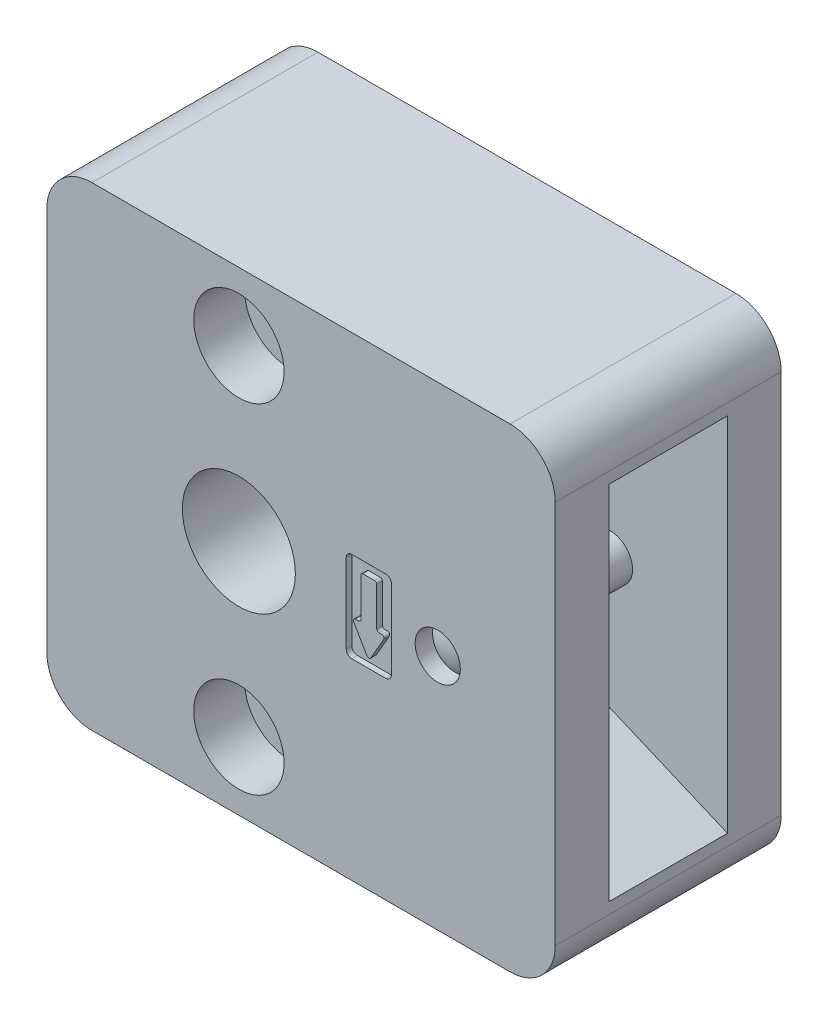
ISO-10303-21;
HEADER;
FILE_DESCRIPTION(('STEP AP214'),'2;1');
FILE_NAME('part.step','',(''),(''),'','','');
FILE_SCHEMA(('AUTOMOTIVE_DESIGN { 1 0 10303 214 1 1 1 1 }'));
ENDSEC;
DATA;
#1=APPLICATION_CONTEXT('core data for automotive mechanical design processes');
#2=APPLICATION_PROTOCOL_DEFINITION('international standard','automotive_design',2000,#1);
#3=PRODUCT_CONTEXT('',#1,'mechanical');
#4=PRODUCT('Part','Part','',(#3));
#5=PRODUCT_RELATED_PRODUCT_CATEGORY('part','',(#4));
#6=PRODUCT_DEFINITION_FORMATION('','',#4);
#7=PRODUCT_DEFINITION_CONTEXT('part definition',#1,'design');
#8=PRODUCT_DEFINITION('design','',#6,#7);
#9=PRODUCT_DEFINITION_SHAPE('','',#8);
#10=(LENGTH_UNIT() NAMED_UNIT(*) SI_UNIT(.MILLI.,.METRE.));
#11=(NAMED_UNIT(*) PLANE_ANGLE_UNIT() SI_UNIT($,.RADIAN.));
#12=(NAMED_UNIT(*) SI_UNIT($,.STERADIAN.) SOLID_ANGLE_UNIT());
#13=UNCERTAINTY_MEASURE_WITH_UNIT(LENGTH_MEASURE(1.E-05),#10,'distance_accuracy_value','');
#14=(GEOMETRIC_REPRESENTATION_CONTEXT(3) GLOBAL_UNCERTAINTY_ASSIGNED_CONTEXT((#13)) GLOBAL_UNIT_ASSIGNED_CONTEXT((#10,
#11,#12)) REPRESENTATION_CONTEXT('',''));
#15=CARTESIAN_POINT('',(0.,0.,0.));
#16=DIRECTION('',(0.,0.,1.));
#17=DIRECTION('',(1.,0.,0.));
#18=AXIS2_PLACEMENT_3D('',#15,#16,#17);
#19=CARTESIAN_POINT('',(17.6,0.,1.));
#20=DIRECTION('',(0.,0.,1.));
#21=DIRECTION('',(0.999190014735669,-0.0402407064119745,0.));
#22=AXIS2_PLACEMENT_3D('',#19,#20,#21);
#23=PLANE('',#22);
#24=CARTESIAN_POINT('',(17.6,0.,1.));
#25=DIRECTION('',(0.,0.,1.));
#26=DIRECTION('',(0.999190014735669,-0.0402407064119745,0.));
#27=AXIS2_PLACEMENT_3D('',#24,#25,#26);
#28=CIRCLE('',#27,1.8311920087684);
#29=CARTESIAN_POINT('',(19.4297087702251,-0.073688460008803,1.));
#30=VERTEX_POINT('',#29);
#31=EDGE_CURVE('E948',#30,#30,#28,.F.);
#32=ORIENTED_EDGE('',*,*,#31,.T.);
#33=EDGE_LOOP('',(#32));
#34=FACE_BOUND('',#33,.T.);
#35=ADVANCED_FACE('F14',(#34),#23,.F.);
#36=CARTESIAN_POINT('',(17.6,0.,1.63));
#37=DIRECTION('',(0.,0.,1.));
#38=DIRECTION('',(0.999190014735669,-0.0402407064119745,0.));
#39=AXIS2_PLACEMENT_3D('',#36,#37,#38);
#40=CONICAL_SURFACE('',#39,2.,0.261799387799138);
#41=CARTESIAN_POINT('',(17.6,0.,1.63));
#42=DIRECTION('',(0.,0.,-1.));
#43=DIRECTION('',(-0.999190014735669,0.0402407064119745,0.));
#44=AXIS2_PLACEMENT_3D('',#41,#42,#43);
#45=CIRCLE('',#44,2.);
#46=CARTESIAN_POINT('',(15.6016199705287,0.080481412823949,1.63));
#47=VERTEX_POINT('',#46);
#48=EDGE_CURVE('E945',#47,#47,#45,.T.);
#49=ORIENTED_EDGE('',*,*,#48,.T.);
#50=EDGE_LOOP('',(#49));
#51=FACE_BOUND('',#50,.T.);
#52=ORIENTED_EDGE('',*,*,#31,.F.);
#53=EDGE_LOOP('',(#52));
#54=FACE_BOUND('',#53,.T.);
#55=ADVANCED_FACE('F974',(#51,#54),#40,.T.);
#56=CARTESIAN_POINT('',(17.6,0.,15.));
#57=DIRECTION('',(0.,0.,1.));
#58=DIRECTION('',(0.999190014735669,-0.0402407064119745,0.));
#59=AXIS2_PLACEMENT_3D('',#56,#57,#58);
#60=SPHERICAL_SURFACE('',#59,4.);
#61=CARTESIAN_POINT('',(17.6,0.,18.4641016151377));
#62=DIRECTION('',(0.,0.,-1.));
#63=DIRECTION('',(-0.999190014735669,0.0402407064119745,0.));
#64=AXIS2_PLACEMENT_3D('',#61,#62,#63);
#65=CIRCLE('',#64,2.);
#66=CARTESIAN_POINT('',(15.6016199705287,0.080481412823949,18.4641016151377));
#67=VERTEX_POINT('',#66);
#68=EDGE_CURVE('E949',#67,#67,#65,.F.);
#69=ORIENTED_EDGE('',*,*,#68,.T.);
#70=EDGE_LOOP('',(#69));
#71=FACE_BOUND('',#70,.T.);
#72=ADVANCED_FACE('F960',(#71),#60,.T.);
#73=CARTESIAN_POINT('',(17.6,0.,19.));
#74=DIRECTION('',(0.,0.,-1.));
#75=DIRECTION('',(-0.999190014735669,0.0402407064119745,0.));
#76=AXIS2_PLACEMENT_3D('',#73,#74,#75);
#77=CYLINDRICAL_SURFACE('',#76,2.);
#78=CARTESIAN_POINT('',(17.6,0.,4.75));
#79=DIRECTION('',(0.,0.,1.));
#80=DIRECTION('',(1.,0.,0.));
#81=AXIS2_PLACEMENT_3D('',#78,#79,#80);
#82=CIRCLE('',#81,2.);
#83=CARTESIAN_POINT('',(19.6,0.,4.75));
#84=VERTEX_POINT('',#83);
#85=EDGE_CURVE('E9',#84,#84,#82,.T.);
#86=ORIENTED_EDGE('',*,*,#85,.T.);
#87=EDGE_LOOP('',(#86));
#88=FACE_BOUND('',#87,.T.);
#89=CARTESIAN_POINT('',(17.6,0.,15.25));
#90=DIRECTION('',(0.,0.,1.));
#91=DIRECTION('',(1.,0.,0.));
#92=AXIS2_PLACEMENT_3D('',#89,#90,#91);
#93=CIRCLE('',#92,2.);
#94=CARTESIAN_POINT('',(19.6,0.,15.25));
#95=VERTEX_POINT('',#94);
#96=EDGE_CURVE('E22',#95,#95,#93,.T.);
#97=ORIENTED_EDGE('',*,*,#96,.F.);
#98=EDGE_LOOP('',(#97));
#99=FACE_BOUND('',#98,.T.);
#100=ADVANCED_FACE('F16',(#88,#99),#77,.T.);
#101=CARTESIAN_POINT('',(11.5,-2.9980762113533,20.));
#102=DIRECTION('',(0.,0.,-1.));
#103=DIRECTION('',(-1.,0.,0.));
#104=AXIS2_PLACEMENT_3D('',#101,#102,#103);
#105=PLANE('',#104);
#106=CARTESIAN_POINT('',(11.5,-2.9980762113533,20.));
#107=DIRECTION('',(0.,0.,1.));
#108=DIRECTION('',(-1.,0.,0.));
#109=AXIS2_PLACEMENT_3D('',#106,#107,#108);
#110=CIRCLE('',#109,0.2);
#111=CARTESIAN_POINT('',(11.3267949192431,-3.0980762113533,20.));
#112=VERTEX_POINT('',#111);
#113=CARTESIAN_POINT('',(11.6732050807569,-3.0980762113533,20.));
#114=VERTEX_POINT('',#113);
#115=EDGE_CURVE('E625',#112,#114,#110,.T.);
#116=ORIENTED_EDGE('',*,*,#115,.T.);
#117=DIRECTION('',(0.5,0.866025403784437,0.));
#118=VECTOR('',#117,1.);
#119=CARTESIAN_POINT('',(12.8267949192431,-1.1,20.));
#120=LINE('',#119,#118);
#121=CARTESIAN_POINT('',(12.8267949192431,-1.1,20.));
#122=VERTEX_POINT('',#121);
#123=EDGE_CURVE('E628',#114,#122,#120,.T.);
#124=ORIENTED_EDGE('',*,*,#123,.T.);
#125=CARTESIAN_POINT('',(12.6535898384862,-1.,20.));
#126=DIRECTION('',(0.,0.,1.));
#127=DIRECTION('',(1.,0.,0.));
#128=AXIS2_PLACEMENT_3D('',#125,#126,#127);
#129=CIRCLE('',#128,0.2);
#130=CARTESIAN_POINT('',(12.6535898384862,-0.8,20.));
#131=VERTEX_POINT('',#130);
#132=EDGE_CURVE('E630',#122,#131,#129,.T.);
#133=ORIENTED_EDGE('',*,*,#132,.T.);
#134=DIRECTION('',(-1.,0.,0.));
#135=VECTOR('',#134,1.);
#136=CARTESIAN_POINT('',(12.4,-0.8,20.));
#137=LINE('',#136,#135);
#138=CARTESIAN_POINT('',(12.4,-0.8,20.));
#139=VERTEX_POINT('',#138);
#140=EDGE_CURVE('E632',#131,#139,#137,.T.);
#141=ORIENTED_EDGE('',*,*,#140,.T.);
#142=CARTESIAN_POINT('',(12.4,-0.6,20.));
#143=DIRECTION('',(0.,0.,-1.));
#144=DIRECTION('',(-1.,0.,0.));
#145=AXIS2_PLACEMENT_3D('',#142,#143,#144);
#146=CIRCLE('',#145,0.2);
#147=CARTESIAN_POINT('',(12.2,-0.6,20.));
#148=VERTEX_POINT('',#147);
#149=EDGE_CURVE('E634',#139,#148,#146,.T.);
#150=ORIENTED_EDGE('',*,*,#149,.T.);
#151=DIRECTION('',(0.,1.,0.));
#152=VECTOR('',#151,1.);
#153=CARTESIAN_POINT('',(12.2,2.8,20.));
#154=LINE('',#153,#152);
#155=CARTESIAN_POINT('',(12.2,2.8,20.));
#156=VERTEX_POINT('',#155);
#157=EDGE_CURVE('E636',#148,#156,#154,.T.);
#158=ORIENTED_EDGE('',*,*,#157,.T.);
#159=CARTESIAN_POINT('',(12.,2.8,20.));
#160=DIRECTION('',(0.,0.,1.));
#161=DIRECTION('',(1.,0.,0.));
#162=AXIS2_PLACEMENT_3D('',#159,#160,#161);
#163=CIRCLE('',#162,0.2);
#164=CARTESIAN_POINT('',(12.,3.,20.));
#165=VERTEX_POINT('',#164);
#166=EDGE_CURVE('E638',#156,#165,#163,.T.);
#167=ORIENTED_EDGE('',*,*,#166,.T.);
#168=DIRECTION('',(-1.,0.,0.));
#169=VECTOR('',#168,1.);
#170=CARTESIAN_POINT('',(12.,3.,20.));
#171=LINE('',#170,#169);
#172=CARTESIAN_POINT('',(11.,3.,20.));
#173=VERTEX_POINT('',#172);
#174=EDGE_CURVE('E640',#165,#173,#171,.T.);
#175=ORIENTED_EDGE('',*,*,#174,.T.);
#176=CARTESIAN_POINT('',(11.,2.8,20.));
#177=DIRECTION('',(0.,0.,1.));
#178=DIRECTION('',(-1.,0.,0.));
#179=AXIS2_PLACEMENT_3D('',#176,#177,#178);
#180=CIRCLE('',#179,0.2);
#181=CARTESIAN_POINT('',(10.8,2.8,20.));
#182=VERTEX_POINT('',#181);
#183=EDGE_CURVE('E642',#173,#182,#180,.T.);
#184=ORIENTED_EDGE('',*,*,#183,.T.);
#185=DIRECTION('',(0.,-1.,0.));
#186=VECTOR('',#185,1.);
#187=CARTESIAN_POINT('',(10.8,2.8,20.));
#188=LINE('',#187,#186);
#189=CARTESIAN_POINT('',(10.8,-0.6,20.));
#190=VERTEX_POINT('',#189);
#191=EDGE_CURVE('E644',#182,#190,#188,.T.);
#192=ORIENTED_EDGE('',*,*,#191,.T.);
#193=CARTESIAN_POINT('',(10.6,-0.6,20.));
#194=DIRECTION('',(0.,0.,-1.));
#195=DIRECTION('',(1.,0.,0.));
#196=AXIS2_PLACEMENT_3D('',#193,#194,#195);
#197=CIRCLE('',#196,0.2);
#198=CARTESIAN_POINT('',(10.6,-0.8,20.));
#199=VERTEX_POINT('',#198);
#200=EDGE_CURVE('E646',#190,#199,#197,.T.);
#201=ORIENTED_EDGE('',*,*,#200,.T.);
#202=DIRECTION('',(-1.,0.,0.));
#203=VECTOR('',#202,1.);
#204=CARTESIAN_POINT('',(10.6,-0.8,20.));
#205=LINE('',#204,#203);
#206=CARTESIAN_POINT('',(10.3464101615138,-0.8,20.));
#207=VERTEX_POINT('',#206);
#208=EDGE_CURVE('E648',#199,#207,#205,.T.);
#209=ORIENTED_EDGE('',*,*,#208,.T.);
#210=CARTESIAN_POINT('',(10.3464101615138,-1.,20.));
#211=DIRECTION('',(0.,0.,1.));
#212=DIRECTION('',(-1.,0.,0.));
#213=AXIS2_PLACEMENT_3D('',#210,#211,#212);
#214=CIRCLE('',#213,0.2);
#215=CARTESIAN_POINT('',(10.1732050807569,-1.1,20.));
#216=VERTEX_POINT('',#215);
#217=EDGE_CURVE('E650',#207,#216,#214,.T.);
#218=ORIENTED_EDGE('',*,*,#217,.T.);
#219=DIRECTION('',(0.5,-0.866025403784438,0.));
#220=VECTOR('',#219,1.);
#221=CARTESIAN_POINT('',(10.1732050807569,-1.1,20.));
#222=LINE('',#221,#220);
#223=EDGE_CURVE('E652',#216,#112,#222,.T.);
#224=ORIENTED_EDGE('',*,*,#223,.T.);
#225=EDGE_LOOP('',(#116,#124,#133,#141,#150,#158,#167,#175,#184,#192,#201,#209,#218,#224));
#226=FACE_BOUND('',#225,.T.);
#227=ADVANCED_FACE('F959',(#226),#105,.F.);
#228=CARTESIAN_POINT('',(11.5,-2.9980762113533,0.));
#229=DIRECTION('',(0.,0.,1.));
#230=DIRECTION('',(-1.,0.,0.));
#231=AXIS2_PLACEMENT_3D('',#228,#229,#230);
#232=PLANE('',#231);
#233=CARTESIAN_POINT('',(11.5,-2.9980762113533,0.));
#234=DIRECTION('',(0.,0.,1.));
#235=DIRECTION('',(-1.,0.,0.));
#236=AXIS2_PLACEMENT_3D('',#233,#234,#235);
#237=CIRCLE('',#236,0.2);
#238=CARTESIAN_POINT('',(11.3267949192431,-3.0980762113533,0.));
#239=VERTEX_POINT('',#238);
#240=CARTESIAN_POINT('',(11.6732050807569,-3.0980762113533,0.));
#241=VERTEX_POINT('',#240);
#242=EDGE_CURVE('E465',#239,#241,#237,.T.);
#243=ORIENTED_EDGE('',*,*,#242,.F.);
#244=DIRECTION('',(0.5,-0.866025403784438,0.));
#245=VECTOR('',#244,1.);
#246=CARTESIAN_POINT('',(10.1732050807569,-1.1,0.));
#247=LINE('',#246,#245);
#248=CARTESIAN_POINT('',(10.1732050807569,-1.1,0.));
#249=VERTEX_POINT('',#248);
#250=EDGE_CURVE('E412',#249,#239,#247,.T.);
#251=ORIENTED_EDGE('',*,*,#250,.F.);
#252=CARTESIAN_POINT('',(10.3464101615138,-1.,0.));
#253=DIRECTION('',(0.,0.,1.));
#254=DIRECTION('',(-1.,0.,0.));
#255=AXIS2_PLACEMENT_3D('',#252,#253,#254);
#256=CIRCLE('',#255,0.2);
#257=CARTESIAN_POINT('',(10.3464101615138,-0.8,0.));
#258=VERTEX_POINT('',#257);
#259=EDGE_CURVE('E468',#258,#249,#256,.T.);
#260=ORIENTED_EDGE('',*,*,#259,.F.);
#261=DIRECTION('',(-1.,0.,0.));
#262=VECTOR('',#261,1.);
#263=CARTESIAN_POINT('',(10.6,-0.8,0.));
#264=LINE('',#263,#262);
#265=CARTESIAN_POINT('',(10.6,-0.8,0.));
#266=VERTEX_POINT('',#265);
#267=EDGE_CURVE('E471',#266,#258,#264,.T.);
#268=ORIENTED_EDGE('',*,*,#267,.F.);
#269=CARTESIAN_POINT('',(10.6,-0.6,0.));
#270=DIRECTION('',(0.,0.,-1.));
#271=DIRECTION('',(1.,0.,0.));
#272=AXIS2_PLACEMENT_3D('',#269,#270,#271);
#273=CIRCLE('',#272,0.2);
#274=CARTESIAN_POINT('',(10.8,-0.6,0.));
#275=VERTEX_POINT('',#274);
#276=EDGE_CURVE('E474',#275,#266,#273,.T.);
#277=ORIENTED_EDGE('',*,*,#276,.F.);
#278=DIRECTION('',(0.,-1.,0.));
#279=VECTOR('',#278,1.);
#280=CARTESIAN_POINT('',(10.8,2.8,0.));
#281=LINE('',#280,#279);
#282=CARTESIAN_POINT('',(10.8,2.8,0.));
#283=VERTEX_POINT('',#282);
#284=EDGE_CURVE('E477',#283,#275,#281,.T.);
#285=ORIENTED_EDGE('',*,*,#284,.F.);
#286=CARTESIAN_POINT('',(11.,2.8,0.));
#287=DIRECTION('',(0.,0.,1.));
#288=DIRECTION('',(-1.,0.,0.));
#289=AXIS2_PLACEMENT_3D('',#286,#287,#288);
#290=CIRCLE('',#289,0.2);
#291=CARTESIAN_POINT('',(11.,3.,0.));
#292=VERTEX_POINT('',#291);
#293=EDGE_CURVE('E480',#292,#283,#290,.T.);
#294=ORIENTED_EDGE('',*,*,#293,.F.);
#295=DIRECTION('',(-1.,0.,0.));
#296=VECTOR('',#295,1.);
#297=CARTESIAN_POINT('',(12.,3.,0.));
#298=LINE('',#297,#296);
#299=CARTESIAN_POINT('',(12.,3.,0.));
#300=VERTEX_POINT('',#299);
#301=EDGE_CURVE('E483',#300,#292,#298,.T.);
#302=ORIENTED_EDGE('',*,*,#301,.F.);
#303=CARTESIAN_POINT('',(12.,2.8,0.));
#304=DIRECTION('',(0.,0.,1.));
#305=DIRECTION('',(1.,0.,0.));
#306=AXIS2_PLACEMENT_3D('',#303,#304,#305);
#307=CIRCLE('',#306,0.2);
#308=CARTESIAN_POINT('',(12.2,2.8,0.));
#309=VERTEX_POINT('',#308);
#310=EDGE_CURVE('E486',#309,#300,#307,.T.);
#311=ORIENTED_EDGE('',*,*,#310,.F.);
#312=DIRECTION('',(0.,1.,0.));
#313=VECTOR('',#312,1.);
#314=CARTESIAN_POINT('',(12.2,2.8,0.));
#315=LINE('',#314,#313);
#316=CARTESIAN_POINT('',(12.2,-0.6,0.));
#317=VERTEX_POINT('',#316);
#318=EDGE_CURVE('E489',#317,#309,#315,.T.);
#319=ORIENTED_EDGE('',*,*,#318,.F.);
#320=CARTESIAN_POINT('',(12.4,-0.6,0.));
#321=DIRECTION('',(0.,0.,-1.));
#322=DIRECTION('',(-1.,0.,0.));
#323=AXIS2_PLACEMENT_3D('',#320,#321,#322);
#324=CIRCLE('',#323,0.2);
#325=CARTESIAN_POINT('',(12.4,-0.8,0.));
#326=VERTEX_POINT('',#325);
#327=EDGE_CURVE('E492',#326,#317,#324,.T.);
#328=ORIENTED_EDGE('',*,*,#327,.F.);
#329=DIRECTION('',(-1.,0.,0.));
#330=VECTOR('',#329,1.);
#331=CARTESIAN_POINT('',(12.4,-0.8,0.));
#332=LINE('',#331,#330);
#333=CARTESIAN_POINT('',(12.6535898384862,-0.8,0.));
#334=VERTEX_POINT('',#333);
#335=EDGE_CURVE('E495',#334,#326,#332,.T.);
#336=ORIENTED_EDGE('',*,*,#335,.F.);
#337=CARTESIAN_POINT('',(12.6535898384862,-1.,0.));
#338=DIRECTION('',(0.,0.,1.));
#339=DIRECTION('',(1.,0.,0.));
#340=AXIS2_PLACEMENT_3D('',#337,#338,#339);
#341=CIRCLE('',#340,0.2);
#342=CARTESIAN_POINT('',(12.8267949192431,-1.1,0.));
#343=VERTEX_POINT('',#342);
#344=EDGE_CURVE('E498',#343,#334,#341,.T.);
#345=ORIENTED_EDGE('',*,*,#344,.F.);
#346=DIRECTION('',(0.5,0.866025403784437,0.));
#347=VECTOR('',#346,1.);
#348=CARTESIAN_POINT('',(12.8267949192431,-1.1,0.));
#349=LINE('',#348,#347);
#350=EDGE_CURVE('E501',#241,#343,#349,.T.);
#351=ORIENTED_EDGE('',*,*,#350,.F.);
#352=EDGE_LOOP('',(#243,#251,#260,#268,#277,#285,#294,#302,#311,#319,#328,#336,#345,#351));
#353=FACE_BOUND('',#352,.T.);
#354=ADVANCED_FACE('F969',(#353),#232,.F.);
#355=CARTESIAN_POINT('',(12.8267949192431,-1.1,20.));
#356=DIRECTION('',(-0.866025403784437,0.5,0.));
#357=DIRECTION('',(-0.5,-0.866025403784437,0.));
#358=AXIS2_PLACEMENT_3D('',#355,#356,#357);
#359=PLANE('',#358);
#360=DIRECTION('',(0.5,0.866025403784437,0.));
#361=VECTOR('',#360,1.);
#362=CARTESIAN_POINT('',(12.8267949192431,-1.1,19.5));
#363=LINE('',#362,#361);
#364=CARTESIAN_POINT('',(11.6732050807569,-3.0980762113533,19.5));
#365=VERTEX_POINT('',#364);
#366=CARTESIAN_POINT('',(12.8267949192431,-1.1,19.5));
#367=VERTEX_POINT('',#366);
#368=EDGE_CURVE('E586',#365,#367,#363,.T.);
#369=ORIENTED_EDGE('',*,*,#368,.T.);
#370=DIRECTION('',(0.,0.,-1.));
#371=VECTOR('',#370,1.);
#372=CARTESIAN_POINT('',(12.8267949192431,-1.1,20.));
#373=LINE('',#372,#371);
#374=EDGE_CURVE('E690',#122,#367,#373,.T.);
#375=ORIENTED_EDGE('',*,*,#374,.F.);
#376=ORIENTED_EDGE('',*,*,#123,.F.);
#377=DIRECTION('',(0.,0.,-1.));
#378=VECTOR('',#377,1.);
#379=CARTESIAN_POINT('',(11.6732050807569,-3.0980762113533,20.));
#380=LINE('',#379,#378);
#381=EDGE_CURVE('E693',#114,#365,#380,.T.);
#382=ORIENTED_EDGE('',*,*,#381,.T.);
#383=EDGE_LOOP('',(#369,#375,#376,#382));
#384=FACE_BOUND('',#383,.T.);
#385=ADVANCED_FACE('F1162',(#384),#359,.F.);
#386=CARTESIAN_POINT('',(12.6535898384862,-1.,20.));
#387=DIRECTION('',(0.,0.,-1.));
#388=DIRECTION('',(-1.,0.,0.));
#389=AXIS2_PLACEMENT_3D('',#386,#387,#388);
#390=CYLINDRICAL_SURFACE('',#389,0.2);
#391=CARTESIAN_POINT('',(12.6535898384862,-1.,19.5));
#392=DIRECTION('',(0.,0.,1.));
#393=DIRECTION('',(1.,0.,0.));
#394=AXIS2_PLACEMENT_3D('',#391,#392,#393);
#395=CIRCLE('',#394,0.2);
#396=CARTESIAN_POINT('',(12.6535898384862,-0.8,19.5));
#397=VERTEX_POINT('',#396);
#398=EDGE_CURVE('E589',#367,#397,#395,.T.);
#399=ORIENTED_EDGE('',*,*,#398,.T.);
#400=DIRECTION('',(0.,0.,-1.));
#401=VECTOR('',#400,1.);
#402=CARTESIAN_POINT('',(12.6535898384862,-0.8,20.));
#403=LINE('',#402,#401);
#404=EDGE_CURVE('E687',#131,#397,#403,.T.);
#405=ORIENTED_EDGE('',*,*,#404,.F.);
#406=ORIENTED_EDGE('',*,*,#132,.F.);
#407=ORIENTED_EDGE('',*,*,#374,.T.);
#408=EDGE_LOOP('',(#399,#405,#406,#407));
#409=FACE_BOUND('',#408,.T.);
#410=ADVANCED_FACE('F1165',(#409),#390,.T.);
#411=CARTESIAN_POINT('',(12.4,-0.8,20.));
#412=DIRECTION('',(0.,-1.,0.));
#413=DIRECTION('',(1.,0.,0.));
#414=AXIS2_PLACEMENT_3D('',#411,#412,#413);
#415=PLANE('',#414);
#416=DIRECTION('',(-1.,0.,0.));
#417=VECTOR('',#416,1.);
#418=CARTESIAN_POINT('',(12.4,-0.8,19.5));
#419=LINE('',#418,#417);
#420=CARTESIAN_POINT('',(12.4,-0.8,19.5));
#421=VERTEX_POINT('',#420);
#422=EDGE_CURVE('E592',#397,#421,#419,.T.);
#423=ORIENTED_EDGE('',*,*,#422,.T.);
#424=DIRECTION('',(0.,0.,-1.));
#425=VECTOR('',#424,1.);
#426=CARTESIAN_POINT('',(12.4,-0.8,20.));
#427=LINE('',#426,#425);
#428=EDGE_CURVE('E684',#139,#421,#427,.T.);
#429=ORIENTED_EDGE('',*,*,#428,.F.);
#430=ORIENTED_EDGE('',*,*,#140,.F.);
#431=ORIENTED_EDGE('',*,*,#404,.T.);
#432=EDGE_LOOP('',(#423,#429,#430,#431));
#433=FACE_BOUND('',#432,.T.);
#434=ADVANCED_FACE('F1169',(#433),#415,.F.);
#435=CARTESIAN_POINT('',(12.4,-0.6,20.));
#436=DIRECTION('',(0.,0.,-1.));
#437=DIRECTION('',(-1.,0.,0.));
#438=AXIS2_PLACEMENT_3D('',#435,#436,#437);
#439=CYLINDRICAL_SURFACE('',#438,0.2);
#440=CARTESIAN_POINT('',(12.4,-0.6,19.5));
#441=DIRECTION('',(0.,0.,-1.));
#442=DIRECTION('',(-1.,0.,0.));
#443=AXIS2_PLACEMENT_3D('',#440,#441,#442);
#444=CIRCLE('',#443,0.2);
#445=CARTESIAN_POINT('',(12.2,-0.6,19.5));
#446=VERTEX_POINT('',#445);
#447=EDGE_CURVE('E595',#421,#446,#444,.T.);
#448=ORIENTED_EDGE('',*,*,#447,.T.);
#449=DIRECTION('',(0.,0.,-1.));
#450=VECTOR('',#449,1.);
#451=CARTESIAN_POINT('',(12.2,-0.6,20.));
#452=LINE('',#451,#450);
#453=EDGE_CURVE('E681',#148,#446,#452,.T.);
#454=ORIENTED_EDGE('',*,*,#453,.F.);
#455=ORIENTED_EDGE('',*,*,#149,.F.);
#456=ORIENTED_EDGE('',*,*,#428,.T.);
#457=EDGE_LOOP('',(#448,#454,#455,#456));
#458=FACE_BOUND('',#457,.T.);
#459=ADVANCED_FACE('F1173',(#458),#439,.F.);
#460=CARTESIAN_POINT('',(12.2,2.8,20.));
#461=DIRECTION('',(-1.,0.,0.));
#462=DIRECTION('',(0.,0.,1.));
#463=AXIS2_PLACEMENT_3D('',#460,#461,#462);
#464=PLANE('',#463);
#465=DIRECTION('',(0.,1.,0.));
#466=VECTOR('',#465,1.);
#467=CARTESIAN_POINT('',(12.2,2.8,19.5));
#468=LINE('',#467,#466);
#469=CARTESIAN_POINT('',(12.2,2.8,19.5));
#470=VERTEX_POINT('',#469);
#471=EDGE_CURVE('E598',#446,#470,#468,.T.);
#472=ORIENTED_EDGE('',*,*,#471,.T.);
#473=DIRECTION('',(0.,0.,-1.));
#474=VECTOR('',#473,1.);
#475=CARTESIAN_POINT('',(12.2,2.8,20.));
#476=LINE('',#475,#474);
#477=EDGE_CURVE('E678',#156,#470,#476,.T.);
#478=ORIENTED_EDGE('',*,*,#477,.F.);
#479=ORIENTED_EDGE('',*,*,#157,.F.);
#480=ORIENTED_EDGE('',*,*,#453,.T.);
#481=EDGE_LOOP('',(#472,#478,#479,#480));
#482=FACE_BOUND('',#481,.T.);
#483=ADVANCED_FACE('F1177',(#482),#464,.F.);
#484=CARTESIAN_POINT('',(12.,2.8,20.));
#485=DIRECTION('',(0.,0.,-1.));
#486=DIRECTION('',(-1.,0.,0.));
#487=AXIS2_PLACEMENT_3D('',#484,#485,#486);
#488=CYLINDRICAL_SURFACE('',#487,0.2);
#489=CARTESIAN_POINT('',(12.,2.8,19.5));
#490=DIRECTION('',(0.,0.,1.));
#491=DIRECTION('',(1.,0.,0.));
#492=AXIS2_PLACEMENT_3D('',#489,#490,#491);
#493=CIRCLE('',#492,0.2);
#494=CARTESIAN_POINT('',(12.,3.,19.5));
#495=VERTEX_POINT('',#494);
#496=EDGE_CURVE('E601',#470,#495,#493,.T.);
#497=ORIENTED_EDGE('',*,*,#496,.T.);
#498=DIRECTION('',(0.,0.,-1.));
#499=VECTOR('',#498,1.);
#500=CARTESIAN_POINT('',(12.,3.,20.));
#501=LINE('',#500,#499);
#502=EDGE_CURVE('E675',#165,#495,#501,.T.);
#503=ORIENTED_EDGE('',*,*,#502,.F.);
#504=ORIENTED_EDGE('',*,*,#166,.F.);
#505=ORIENTED_EDGE('',*,*,#477,.T.);
#506=EDGE_LOOP('',(#497,#503,#504,#505));
#507=FACE_BOUND('',#506,.T.);
#508=ADVANCED_FACE('F1181',(#507),#488,.T.);
#509=CARTESIAN_POINT('',(12.,3.,20.));
#510=DIRECTION('',(0.,-1.,0.));
#511=DIRECTION('',(0.,0.,-1.));
#512=AXIS2_PLACEMENT_3D('',#509,#510,#511);
#513=PLANE('',#512);
#514=DIRECTION('',(-1.,0.,0.));
#515=VECTOR('',#514,1.);
#516=CARTESIAN_POINT('',(12.,3.,19.5));
#517=LINE('',#516,#515);
#518=CARTESIAN_POINT('',(11.,3.,19.5));
#519=VERTEX_POINT('',#518);
#520=EDGE_CURVE('E604',#495,#519,#517,.T.);
#521=ORIENTED_EDGE('',*,*,#520,.T.);
#522=DIRECTION('',(0.,0.,-1.));
#523=VECTOR('',#522,1.);
#524=CARTESIAN_POINT('',(11.,3.,20.));
#525=LINE('',#524,#523);
#526=EDGE_CURVE('E672',#173,#519,#525,.T.);
#527=ORIENTED_EDGE('',*,*,#526,.F.);
#528=ORIENTED_EDGE('',*,*,#174,.F.);
#529=ORIENTED_EDGE('',*,*,#502,.T.);
#530=EDGE_LOOP('',(#521,#527,#528,#529));
#531=FACE_BOUND('',#530,.T.);
#532=ADVANCED_FACE('F1185',(#531),#513,.F.);
#533=CARTESIAN_POINT('',(11.,2.8,20.));
#534=DIRECTION('',(0.,0.,-1.));
#535=DIRECTION('',(-1.,0.,0.));
#536=AXIS2_PLACEMENT_3D('',#533,#534,#535);
#537=CYLINDRICAL_SURFACE('',#536,0.2);
#538=CARTESIAN_POINT('',(11.,2.8,19.5));
#539=DIRECTION('',(0.,0.,1.));
#540=DIRECTION('',(-1.,0.,0.));
#541=AXIS2_PLACEMENT_3D('',#538,#539,#540);
#542=CIRCLE('',#541,0.2);
#543=CARTESIAN_POINT('',(10.8,2.8,19.5));
#544=VERTEX_POINT('',#543);
#545=EDGE_CURVE('E607',#519,#544,#542,.T.);
#546=ORIENTED_EDGE('',*,*,#545,.T.);
#547=DIRECTION('',(0.,0.,-1.));
#548=VECTOR('',#547,1.);
#549=CARTESIAN_POINT('',(10.8,2.8,20.));
#550=LINE('',#549,#548);
#551=EDGE_CURVE('E669',#182,#544,#550,.T.);
#552=ORIENTED_EDGE('',*,*,#551,.F.);
#553=ORIENTED_EDGE('',*,*,#183,.F.);
#554=ORIENTED_EDGE('',*,*,#526,.T.);
#555=EDGE_LOOP('',(#546,#552,#553,#554));
#556=FACE_BOUND('',#555,.T.);
#557=ADVANCED_FACE('F1189',(#556),#537,.T.);
#558=CARTESIAN_POINT('',(10.8,2.8,20.));
#559=DIRECTION('',(1.,0.,0.));
#560=DIRECTION('',(0.,1.,0.));
#561=AXIS2_PLACEMENT_3D('',#558,#559,#560);
#562=PLANE('',#561);
#563=DIRECTION('',(0.,-1.,0.));
#564=VECTOR('',#563,1.);
#565=CARTESIAN_POINT('',(10.8,2.8,19.5));
#566=LINE('',#565,#564);
#567=CARTESIAN_POINT('',(10.8,-0.6,19.5));
#568=VERTEX_POINT('',#567);
#569=EDGE_CURVE('E610',#544,#568,#566,.T.);
#570=ORIENTED_EDGE('',*,*,#569,.T.);
#571=DIRECTION('',(0.,0.,-1.));
#572=VECTOR('',#571,1.);
#573=CARTESIAN_POINT('',(10.8,-0.6,20.));
#574=LINE('',#573,#572);
#575=EDGE_CURVE('E666',#190,#568,#574,.T.);
#576=ORIENTED_EDGE('',*,*,#575,.F.);
#577=ORIENTED_EDGE('',*,*,#191,.F.);
#578=ORIENTED_EDGE('',*,*,#551,.T.);
#579=EDGE_LOOP('',(#570,#576,#577,#578));
#580=FACE_BOUND('',#579,.T.);
#581=ADVANCED_FACE('F1193',(#580),#562,.F.);
#582=CARTESIAN_POINT('',(10.6,-0.6,20.));
#583=DIRECTION('',(0.,0.,-1.));
#584=DIRECTION('',(-1.,0.,0.));
#585=AXIS2_PLACEMENT_3D('',#582,#583,#584);
#586=CYLINDRICAL_SURFACE('',#585,0.2);
#587=CARTESIAN_POINT('',(10.6,-0.6,19.5));
#588=DIRECTION('',(0.,0.,-1.));
#589=DIRECTION('',(1.,0.,0.));
#590=AXIS2_PLACEMENT_3D('',#587,#588,#589);
#591=CIRCLE('',#590,0.2);
#592=CARTESIAN_POINT('',(10.6,-0.8,19.5));
#593=VERTEX_POINT('',#592);
#594=EDGE_CURVE('E613',#568,#593,#591,.T.);
#595=ORIENTED_EDGE('',*,*,#594,.T.);
#596=DIRECTION('',(0.,0.,-1.));
#597=VECTOR('',#596,1.);
#598=CARTESIAN_POINT('',(10.6,-0.8,20.));
#599=LINE('',#598,#597);
#600=EDGE_CURVE('E663',#199,#593,#599,.T.);
#601=ORIENTED_EDGE('',*,*,#600,.F.);
#602=ORIENTED_EDGE('',*,*,#200,.F.);
#603=ORIENTED_EDGE('',*,*,#575,.T.);
#604=EDGE_LOOP('',(#595,#601,#602,#603));
#605=FACE_BOUND('',#604,.T.);
#606=ADVANCED_FACE('F1197',(#605),#586,.F.);
#607=CARTESIAN_POINT('',(10.6,-0.8,20.));
#608=DIRECTION('',(0.,-1.,0.));
#609=DIRECTION('',(1.,0.,0.));
#610=AXIS2_PLACEMENT_3D('',#607,#608,#609);
#611=PLANE('',#610);
#612=DIRECTION('',(-1.,0.,0.));
#613=VECTOR('',#612,1.);
#614=CARTESIAN_POINT('',(10.6,-0.8,19.5));
#615=LINE('',#614,#613);
#616=CARTESIAN_POINT('',(10.3464101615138,-0.8,19.5));
#617=VERTEX_POINT('',#616);
#618=EDGE_CURVE('E616',#593,#617,#615,.T.);
#619=ORIENTED_EDGE('',*,*,#618,.T.);
#620=DIRECTION('',(0.,0.,-1.));
#621=VECTOR('',#620,1.);
#622=CARTESIAN_POINT('',(10.3464101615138,-0.8,20.));
#623=LINE('',#622,#621);
#624=EDGE_CURVE('E660',#207,#617,#623,.T.);
#625=ORIENTED_EDGE('',*,*,#624,.F.);
#626=ORIENTED_EDGE('',*,*,#208,.F.);
#627=ORIENTED_EDGE('',*,*,#600,.T.);
#628=EDGE_LOOP('',(#619,#625,#626,#627));
#629=FACE_BOUND('',#628,.T.);
#630=ADVANCED_FACE('F1201',(#629),#611,.F.);
#631=CARTESIAN_POINT('',(10.3464101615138,-1.,20.));
#632=DIRECTION('',(0.,0.,-1.));
#633=DIRECTION('',(-1.,0.,0.));
#634=AXIS2_PLACEMENT_3D('',#631,#632,#633);
#635=CYLINDRICAL_SURFACE('',#634,0.2);
#636=CARTESIAN_POINT('',(10.3464101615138,-1.,19.5));
#637=DIRECTION('',(0.,0.,1.));
#638=DIRECTION('',(-1.,0.,0.));
#639=AXIS2_PLACEMENT_3D('',#636,#637,#638);
#640=CIRCLE('',#639,0.2);
#641=CARTESIAN_POINT('',(10.1732050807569,-1.1,19.5));
#642=VERTEX_POINT('',#641);
#643=EDGE_CURVE('E619',#617,#642,#640,.T.);
#644=ORIENTED_EDGE('',*,*,#643,.T.);
#645=DIRECTION('',(0.,0.,-1.));
#646=VECTOR('',#645,1.);
#647=CARTESIAN_POINT('',(10.1732050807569,-1.1,20.));
#648=LINE('',#647,#646);
#649=EDGE_CURVE('E657',#216,#642,#648,.T.);
#650=ORIENTED_EDGE('',*,*,#649,.F.);
#651=ORIENTED_EDGE('',*,*,#217,.F.);
#652=ORIENTED_EDGE('',*,*,#624,.T.);
#653=EDGE_LOOP('',(#644,#650,#651,#652));
#654=FACE_BOUND('',#653,.T.);
#655=ADVANCED_FACE('F1205',(#654),#635,.T.);
#656=CARTESIAN_POINT('',(10.1732050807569,-1.1,20.));
#657=DIRECTION('',(0.866025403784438,0.5,0.));
#658=DIRECTION('',(-0.5,0.866025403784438,0.));
#659=AXIS2_PLACEMENT_3D('',#656,#657,#658);
#660=PLANE('',#659);
#661=DIRECTION('',(0.5,-0.866025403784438,0.));
#662=VECTOR('',#661,1.);
#663=CARTESIAN_POINT('',(10.1732050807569,-1.1,19.5));
#664=LINE('',#663,#662);
#665=CARTESIAN_POINT('',(11.3267949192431,-3.0980762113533,19.5));
#666=VERTEX_POINT('',#665);
#667=EDGE_CURVE('E622',#642,#666,#664,.T.);
#668=ORIENTED_EDGE('',*,*,#667,.T.);
#669=DIRECTION('',(0.,0.,-1.));
#670=VECTOR('',#669,1.);
#671=CARTESIAN_POINT('',(11.3267949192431,-3.0980762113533,20.));
#672=LINE('',#671,#670);
#673=EDGE_CURVE('E654',#112,#666,#672,.T.);
#674=ORIENTED_EDGE('',*,*,#673,.F.);
#675=ORIENTED_EDGE('',*,*,#223,.F.);
#676=ORIENTED_EDGE('',*,*,#649,.T.);
#677=EDGE_LOOP('',(#668,#674,#675,#676));
#678=FACE_BOUND('',#677,.T.);
#679=ADVANCED_FACE('F973',(#678),#660,.F.);
#680=CARTESIAN_POINT('',(11.5,-2.9980762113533,20.));
#681=DIRECTION('',(0.,0.,-1.));
#682=DIRECTION('',(-1.,0.,0.));
#683=AXIS2_PLACEMENT_3D('',#680,#681,#682);
#684=CYLINDRICAL_SURFACE('',#683,0.2);
#685=CARTESIAN_POINT('',(11.5,-2.9980762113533,19.5));
#686=DIRECTION('',(0.,0.,1.));
#687=DIRECTION('',(-1.,0.,0.));
#688=AXIS2_PLACEMENT_3D('',#685,#686,#687);
#689=CIRCLE('',#688,0.2);
#690=EDGE_CURVE('E570',#666,#365,#689,.T.);
#691=ORIENTED_EDGE('',*,*,#690,.T.);
#692=ORIENTED_EDGE('',*,*,#381,.F.);
#693=ORIENTED_EDGE('',*,*,#115,.F.);
#694=ORIENTED_EDGE('',*,*,#673,.T.);
#695=EDGE_LOOP('',(#691,#692,#693,#694));
#696=FACE_BOUND('',#695,.T.);
#697=ADVANCED_FACE('F1132',(#696),#684,.T.);
#698=CARTESIAN_POINT('',(10.3464101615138,-1.,0.));
#699=DIRECTION('',(0.,0.,1.));
#700=DIRECTION('',(1.,0.,0.));
#701=AXIS2_PLACEMENT_3D('',#698,#699,#700);
#702=CYLINDRICAL_SURFACE('',#701,0.2);
#703=CARTESIAN_POINT('',(10.3464101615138,-1.,0.5));
#704=DIRECTION('',(0.,0.,1.));
#705=DIRECTION('',(-1.,0.,0.));
#706=AXIS2_PLACEMENT_3D('',#703,#704,#705);
#707=CIRCLE('',#706,0.2);
#708=CARTESIAN_POINT('',(10.3464101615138,-0.8,0.5));
#709=VERTEX_POINT('',#708);
#710=CARTESIAN_POINT('',(10.1732050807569,-1.1,0.5));
#711=VERTEX_POINT('',#710);
#712=EDGE_CURVE('E431',#709,#711,#707,.T.);
#713=ORIENTED_EDGE('',*,*,#712,.F.);
#714=DIRECTION('',(0.,0.,1.));
#715=VECTOR('',#714,1.);
#716=CARTESIAN_POINT('',(10.3464101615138,-0.8,0.));
#717=LINE('',#716,#715);
#718=EDGE_CURVE('E525',#258,#709,#717,.T.);
#719=ORIENTED_EDGE('',*,*,#718,.F.);
#720=ORIENTED_EDGE('',*,*,#259,.T.);
#721=DIRECTION('',(0.,0.,1.));
#722=VECTOR('',#721,1.);
#723=CARTESIAN_POINT('',(10.1732050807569,-1.1,0.));
#724=LINE('',#723,#722);
#725=EDGE_CURVE('E416',#249,#711,#724,.T.);
#726=ORIENTED_EDGE('',*,*,#725,.T.);
#727=EDGE_LOOP('',(#713,#719,#720,#726));
#728=FACE_BOUND('',#727,.T.);
#729=ADVANCED_FACE('F1160',(#728),#702,.T.);
#730=CARTESIAN_POINT('',(10.6,-0.8,0.));
#731=DIRECTION('',(0.,1.,0.));
#732=DIRECTION('',(-1.,0.,0.));
#733=AXIS2_PLACEMENT_3D('',#730,#731,#732);
#734=PLANE('',#733);
#735=DIRECTION('',(-1.,0.,0.));
#736=VECTOR('',#735,1.);
#737=CARTESIAN_POINT('',(10.6,-0.8,0.5));
#738=LINE('',#737,#736);
#739=CARTESIAN_POINT('',(10.6,-0.8,0.5));
#740=VERTEX_POINT('',#739);
#741=EDGE_CURVE('E433',#740,#709,#738,.T.);
#742=ORIENTED_EDGE('',*,*,#741,.F.);
#743=DIRECTION('',(0.,0.,1.));
#744=VECTOR('',#743,1.);
#745=CARTESIAN_POINT('',(10.6,-0.8,0.));
#746=LINE('',#745,#744);
#747=EDGE_CURVE('E523',#266,#740,#746,.T.);
#748=ORIENTED_EDGE('',*,*,#747,.F.);
#749=ORIENTED_EDGE('',*,*,#267,.T.);
#750=ORIENTED_EDGE('',*,*,#718,.T.);
#751=EDGE_LOOP('',(#742,#748,#749,#750));
#752=FACE_BOUND('',#751,.T.);
#753=ADVANCED_FACE('F1250',(#752),#734,.T.);
#754=CARTESIAN_POINT('',(10.6,-0.6,0.));
#755=DIRECTION('',(0.,0.,1.));
#756=DIRECTION('',(1.,0.,0.));
#757=AXIS2_PLACEMENT_3D('',#754,#755,#756);
#758=CYLINDRICAL_SURFACE('',#757,0.2);
#759=CARTESIAN_POINT('',(10.6,-0.6,0.5));
#760=DIRECTION('',(0.,0.,-1.));
#761=DIRECTION('',(1.,0.,0.));
#762=AXIS2_PLACEMENT_3D('',#759,#760,#761);
#763=CIRCLE('',#762,0.2);
#764=CARTESIAN_POINT('',(10.8,-0.6,0.5));
#765=VERTEX_POINT('',#764);
#766=EDGE_CURVE('E438',#765,#740,#763,.T.);
#767=ORIENTED_EDGE('',*,*,#766,.F.);
#768=DIRECTION('',(0.,0.,1.));
#769=VECTOR('',#768,1.);
#770=CARTESIAN_POINT('',(10.8,-0.6,0.));
#771=LINE('',#770,#769);
#772=EDGE_CURVE('E521',#275,#765,#771,.T.);
#773=ORIENTED_EDGE('',*,*,#772,.F.);
#774=ORIENTED_EDGE('',*,*,#276,.T.);
#775=ORIENTED_EDGE('',*,*,#747,.T.);
#776=EDGE_LOOP('',(#767,#773,#774,#775));
#777=FACE_BOUND('',#776,.T.);
#778=ADVANCED_FACE('F1254',(#777),#758,.F.);
#779=CARTESIAN_POINT('',(10.8,2.8,0.));
#780=DIRECTION('',(-1.,0.,0.));
#781=DIRECTION('',(0.,-1.,0.));
#782=AXIS2_PLACEMENT_3D('',#779,#780,#781);
#783=PLANE('',#782);
#784=DIRECTION('',(0.,-1.,0.));
#785=VECTOR('',#784,1.);
#786=CARTESIAN_POINT('',(10.8,2.8,0.5));
#787=LINE('',#786,#785);
#788=CARTESIAN_POINT('',(10.8,2.8,0.5));
#789=VERTEX_POINT('',#788);
#790=EDGE_CURVE('E441',#789,#765,#787,.T.);
#791=ORIENTED_EDGE('',*,*,#790,.F.);
#792=DIRECTION('',(0.,0.,1.));
#793=VECTOR('',#792,1.);
#794=CARTESIAN_POINT('',(10.8,2.8,0.));
#795=LINE('',#794,#793);
#796=EDGE_CURVE('E519',#283,#789,#795,.T.);
#797=ORIENTED_EDGE('',*,*,#796,.F.);
#798=ORIENTED_EDGE('',*,*,#284,.T.);
#799=ORIENTED_EDGE('',*,*,#772,.T.);
#800=EDGE_LOOP('',(#791,#797,#798,#799));
#801=FACE_BOUND('',#800,.T.);
#802=ADVANCED_FACE('F1258',(#801),#783,.T.);
#803=CARTESIAN_POINT('',(11.,2.8,0.));
#804=DIRECTION('',(0.,0.,1.));
#805=DIRECTION('',(1.,0.,0.));
#806=AXIS2_PLACEMENT_3D('',#803,#804,#805);
#807=CYLINDRICAL_SURFACE('',#806,0.2);
#808=CARTESIAN_POINT('',(11.,2.8,0.5));
#809=DIRECTION('',(0.,0.,1.));
#810=DIRECTION('',(-1.,0.,0.));
#811=AXIS2_PLACEMENT_3D('',#808,#809,#810);
#812=CIRCLE('',#811,0.2);
#813=CARTESIAN_POINT('',(11.,3.,0.5));
#814=VERTEX_POINT('',#813);
#815=EDGE_CURVE('E444',#814,#789,#812,.T.);
#816=ORIENTED_EDGE('',*,*,#815,.F.);
#817=DIRECTION('',(0.,0.,1.));
#818=VECTOR('',#817,1.);
#819=CARTESIAN_POINT('',(11.,3.,0.));
#820=LINE('',#819,#818);
#821=EDGE_CURVE('E517',#292,#814,#820,.T.);
#822=ORIENTED_EDGE('',*,*,#821,.F.);
#823=ORIENTED_EDGE('',*,*,#293,.T.);
#824=ORIENTED_EDGE('',*,*,#796,.T.);
#825=EDGE_LOOP('',(#816,#822,#823,#824));
#826=FACE_BOUND('',#825,.T.);
#827=ADVANCED_FACE('F1262',(#826),#807,.T.);
#828=CARTESIAN_POINT('',(12.,3.,0.));
#829=DIRECTION('',(0.,1.,0.));
#830=DIRECTION('',(0.,0.,1.));
#831=AXIS2_PLACEMENT_3D('',#828,#829,#830);
#832=PLANE('',#831);
#833=DIRECTION('',(-1.,0.,0.));
#834=VECTOR('',#833,1.);
#835=CARTESIAN_POINT('',(12.,3.,0.5));
#836=LINE('',#835,#834);
#837=CARTESIAN_POINT('',(12.,3.,0.5));
#838=VERTEX_POINT('',#837);
#839=EDGE_CURVE('E447',#838,#814,#836,.T.);
#840=ORIENTED_EDGE('',*,*,#839,.F.);
#841=DIRECTION('',(0.,0.,1.));
#842=VECTOR('',#841,1.);
#843=CARTESIAN_POINT('',(12.,3.,0.));
#844=LINE('',#843,#842);
#845=EDGE_CURVE('E515',#300,#838,#844,.T.);
#846=ORIENTED_EDGE('',*,*,#845,.F.);
#847=ORIENTED_EDGE('',*,*,#301,.T.);
#848=ORIENTED_EDGE('',*,*,#821,.T.);
#849=EDGE_LOOP('',(#840,#846,#847,#848));
#850=FACE_BOUND('',#849,.T.);
#851=ADVANCED_FACE('F1266',(#850),#832,.T.);
#852=CARTESIAN_POINT('',(12.,2.8,0.));
#853=DIRECTION('',(0.,0.,1.));
#854=DIRECTION('',(1.,0.,0.));
#855=AXIS2_PLACEMENT_3D('',#852,#853,#854);
#856=CYLINDRICAL_SURFACE('',#855,0.2);
#857=CARTESIAN_POINT('',(12.,2.8,0.5));
#858=DIRECTION('',(0.,0.,1.));
#859=DIRECTION('',(1.,0.,0.));
#860=AXIS2_PLACEMENT_3D('',#857,#858,#859);
#861=CIRCLE('',#860,0.2);
#862=CARTESIAN_POINT('',(12.2,2.8,0.5));
#863=VERTEX_POINT('',#862);
#864=EDGE_CURVE('E450',#863,#838,#861,.T.);
#865=ORIENTED_EDGE('',*,*,#864,.F.);
#866=DIRECTION('',(0.,0.,1.));
#867=VECTOR('',#866,1.);
#868=CARTESIAN_POINT('',(12.2,2.8,0.));
#869=LINE('',#868,#867);
#870=EDGE_CURVE('E513',#309,#863,#869,.T.);
#871=ORIENTED_EDGE('',*,*,#870,.F.);
#872=ORIENTED_EDGE('',*,*,#310,.T.);
#873=ORIENTED_EDGE('',*,*,#845,.T.);
#874=EDGE_LOOP('',(#865,#871,#872,#873));
#875=FACE_BOUND('',#874,.T.);
#876=ADVANCED_FACE('F1270',(#875),#856,.T.);
#877=CARTESIAN_POINT('',(12.2,2.8,0.));
#878=DIRECTION('',(1.,0.,0.));
#879=DIRECTION('',(0.,0.,-1.));
#880=AXIS2_PLACEMENT_3D('',#877,#878,#879);
#881=PLANE('',#880);
#882=DIRECTION('',(0.,1.,0.));
#883=VECTOR('',#882,1.);
#884=CARTESIAN_POINT('',(12.2,2.8,0.5));
#885=LINE('',#884,#883);
#886=CARTESIAN_POINT('',(12.2,-0.6,0.5));
#887=VERTEX_POINT('',#886);
#888=EDGE_CURVE('E453',#887,#863,#885,.T.);
#889=ORIENTED_EDGE('',*,*,#888,.F.);
#890=DIRECTION('',(0.,0.,1.));
#891=VECTOR('',#890,1.);
#892=CARTESIAN_POINT('',(12.2,-0.6,0.));
#893=LINE('',#892,#891);
#894=EDGE_CURVE('E511',#317,#887,#893,.T.);
#895=ORIENTED_EDGE('',*,*,#894,.F.);
#896=ORIENTED_EDGE('',*,*,#318,.T.);
#897=ORIENTED_EDGE('',*,*,#870,.T.);
#898=EDGE_LOOP('',(#889,#895,#896,#897));
#899=FACE_BOUND('',#898,.T.);
#900=ADVANCED_FACE('F1274',(#899),#881,.T.);
#901=CARTESIAN_POINT('',(12.4,-0.6,0.));
#902=DIRECTION('',(0.,0.,1.));
#903=DIRECTION('',(1.,0.,0.));
#904=AXIS2_PLACEMENT_3D('',#901,#902,#903);
#905=CYLINDRICAL_SURFACE('',#904,0.2);
#906=CARTESIAN_POINT('',(12.4,-0.6,0.5));
#907=DIRECTION('',(0.,0.,-1.));
#908=DIRECTION('',(-1.,0.,0.));
#909=AXIS2_PLACEMENT_3D('',#906,#907,#908);
#910=CIRCLE('',#909,0.2);
#911=CARTESIAN_POINT('',(12.4,-0.8,0.5));
#912=VERTEX_POINT('',#911);
#913=EDGE_CURVE('E456',#912,#887,#910,.T.);
#914=ORIENTED_EDGE('',*,*,#913,.F.);
#915=DIRECTION('',(0.,0.,1.));
#916=VECTOR('',#915,1.);
#917=CARTESIAN_POINT('',(12.4,-0.8,0.));
#918=LINE('',#917,#916);
#919=EDGE_CURVE('E509',#326,#912,#918,.T.);
#920=ORIENTED_EDGE('',*,*,#919,.F.);
#921=ORIENTED_EDGE('',*,*,#327,.T.);
#922=ORIENTED_EDGE('',*,*,#894,.T.);
#923=EDGE_LOOP('',(#914,#920,#921,#922));
#924=FACE_BOUND('',#923,.T.);
#925=ADVANCED_FACE('F1278',(#924),#905,.F.);
#926=CARTESIAN_POINT('',(12.4,-0.8,0.));
#927=DIRECTION('',(0.,1.,0.));
#928=DIRECTION('',(-1.,0.,0.));
#929=AXIS2_PLACEMENT_3D('',#926,#927,#928);
#930=PLANE('',#929);
#931=DIRECTION('',(-1.,0.,0.));
#932=VECTOR('',#931,1.);
#933=CARTESIAN_POINT('',(12.4,-0.8,0.5));
#934=LINE('',#933,#932);
#935=CARTESIAN_POINT('',(12.6535898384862,-0.8,0.5));
#936=VERTEX_POINT('',#935);
#937=EDGE_CURVE('E459',#936,#912,#934,.T.);
#938=ORIENTED_EDGE('',*,*,#937,.F.);
#939=DIRECTION('',(0.,0.,1.));
#940=VECTOR('',#939,1.);
#941=CARTESIAN_POINT('',(12.6535898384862,-0.8,0.));
#942=LINE('',#941,#940);
#943=EDGE_CURVE('E507',#334,#936,#942,.T.);
#944=ORIENTED_EDGE('',*,*,#943,.F.);
#945=ORIENTED_EDGE('',*,*,#335,.T.);
#946=ORIENTED_EDGE('',*,*,#919,.T.);
#947=EDGE_LOOP('',(#938,#944,#945,#946));
#948=FACE_BOUND('',#947,.T.);
#949=ADVANCED_FACE('F1282',(#948),#930,.T.);
#950=CARTESIAN_POINT('',(12.6535898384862,-1.,0.));
#951=DIRECTION('',(0.,0.,1.));
#952=DIRECTION('',(1.,0.,0.));
#953=AXIS2_PLACEMENT_3D('',#950,#951,#952);
#954=CYLINDRICAL_SURFACE('',#953,0.2);
#955=CARTESIAN_POINT('',(12.6535898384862,-1.,0.5));
#956=DIRECTION('',(0.,0.,1.));
#957=DIRECTION('',(1.,0.,0.));
#958=AXIS2_PLACEMENT_3D('',#955,#956,#957);
#959=CIRCLE('',#958,0.2);
#960=CARTESIAN_POINT('',(12.8267949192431,-1.1,0.5));
#961=VERTEX_POINT('',#960);
#962=EDGE_CURVE('E29',#961,#936,#959,.T.);
#963=ORIENTED_EDGE('',*,*,#962,.F.);
#964=DIRECTION('',(0.,0.,1.));
#965=VECTOR('',#964,1.);
#966=CARTESIAN_POINT('',(12.8267949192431,-1.1,0.));
#967=LINE('',#966,#965);
#968=EDGE_CURVE('E505',#343,#961,#967,.T.);
#969=ORIENTED_EDGE('',*,*,#968,.F.);
#970=ORIENTED_EDGE('',*,*,#344,.T.);
#971=ORIENTED_EDGE('',*,*,#943,.T.);
#972=EDGE_LOOP('',(#963,#969,#970,#971));
#973=FACE_BOUND('',#972,.T.);
#974=ADVANCED_FACE('F1286',(#973),#954,.T.);
#975=CARTESIAN_POINT('',(12.8267949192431,-1.1,0.));
#976=DIRECTION('',(0.866025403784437,-0.5,0.));
#977=DIRECTION('',(0.5,0.866025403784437,0.));
#978=AXIS2_PLACEMENT_3D('',#975,#976,#977);
#979=PLANE('',#978);
#980=DIRECTION('',(0.5,0.866025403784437,0.));
#981=VECTOR('',#980,1.);
#982=CARTESIAN_POINT('',(12.8267949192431,-1.1,0.5));
#983=LINE('',#982,#981);
#984=CARTESIAN_POINT('',(11.6732050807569,-3.0980762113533,0.5));
#985=VERTEX_POINT('',#984);
#986=EDGE_CURVE('E463',#985,#961,#983,.T.);
#987=ORIENTED_EDGE('',*,*,#986,.F.);
#988=DIRECTION('',(0.,0.,1.));
#989=VECTOR('',#988,1.);
#990=CARTESIAN_POINT('',(11.6732050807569,-3.0980762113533,0.));
#991=LINE('',#990,#989);
#992=EDGE_CURVE('E421',#241,#985,#991,.T.);
#993=ORIENTED_EDGE('',*,*,#992,.F.);
#994=ORIENTED_EDGE('',*,*,#350,.T.);
#995=ORIENTED_EDGE('',*,*,#968,.T.);
#996=EDGE_LOOP('',(#987,#993,#994,#995));
#997=FACE_BOUND('',#996,.T.);
#998=ADVANCED_FACE('F1245',(#997),#979,.T.);
#999=CARTESIAN_POINT('',(11.5,-2.9980762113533,0.));
#1000=DIRECTION('',(0.,0.,1.));
#1001=DIRECTION('',(1.,0.,0.));
#1002=AXIS2_PLACEMENT_3D('',#999,#1000,#1001);
#1003=CYLINDRICAL_SURFACE('',#1002,0.2);
#1004=CARTESIAN_POINT('',(11.5,-2.9980762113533,0.5));
#1005=DIRECTION('',(0.,0.,1.));
#1006=DIRECTION('',(-1.,0.,0.));
#1007=AXIS2_PLACEMENT_3D('',#1004,#1005,#1006);
#1008=CIRCLE('',#1007,0.2);
#1009=CARTESIAN_POINT('',(11.3267949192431,-3.0980762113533,0.5));
#1010=VERTEX_POINT('',#1009);
#1011=EDGE_CURVE('E419',#1010,#985,#1008,.T.);
#1012=ORIENTED_EDGE('',*,*,#1011,.F.);
#1013=DIRECTION('',(0.,0.,1.));
#1014=VECTOR('',#1013,1.);
#1015=CARTESIAN_POINT('',(11.3267949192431,-3.0980762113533,0.));
#1016=LINE('',#1015,#1014);
#1017=EDGE_CURVE('E405',#239,#1010,#1016,.T.);
#1018=ORIENTED_EDGE('',*,*,#1017,.F.);
#1019=ORIENTED_EDGE('',*,*,#242,.T.);
#1020=ORIENTED_EDGE('',*,*,#992,.T.);
#1021=EDGE_LOOP('',(#1012,#1018,#1019,#1020));
#1022=FACE_BOUND('',#1021,.T.);
#1023=ADVANCED_FACE('F420',(#1022),#1003,.T.);
#1024=CARTESIAN_POINT('',(10.1732050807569,-1.1,0.));
#1025=DIRECTION('',(-0.866025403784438,-0.5,0.));
#1026=DIRECTION('',(0.5,-0.866025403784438,0.));
#1027=AXIS2_PLACEMENT_3D('',#1024,#1025,#1026);
#1028=PLANE('',#1027);
#1029=DIRECTION('',(0.5,-0.866025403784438,0.));
#1030=VECTOR('',#1029,1.);
#1031=CARTESIAN_POINT('',(10.1732050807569,-1.1,0.5));
#1032=LINE('',#1031,#1030);
#1033=EDGE_CURVE('E409',#711,#1010,#1032,.T.);
#1034=ORIENTED_EDGE('',*,*,#1033,.F.);
#1035=ORIENTED_EDGE('',*,*,#725,.F.);
#1036=ORIENTED_EDGE('',*,*,#250,.T.);
#1037=ORIENTED_EDGE('',*,*,#1017,.T.);
#1038=EDGE_LOOP('',(#1034,#1035,#1036,#1037));
#1039=FACE_BOUND('',#1038,.T.);
#1040=ADVANCED_FACE('F407',(#1039),#1028,.T.);
#1041=CARTESIAN_POINT('',(0.,-15.,20.));
#1042=DIRECTION('',(0.,0.,1.));
#1043=DIRECTION('',(1.,0.,0.));
#1044=AXIS2_PLACEMENT_3D('',#1041,#1042,#1043);
#1045=CYLINDRICAL_SURFACE('',#1044,2.25);
#1046=CARTESIAN_POINT('',(0.,-15.,15.5));
#1047=DIRECTION('',(0.,0.,1.));
#1048=DIRECTION('',(1.,0.,0.));
#1049=AXIS2_PLACEMENT_3D('',#1046,#1047,#1048);
#1050=CIRCLE('',#1049,2.25);
#1051=CARTESIAN_POINT('',(2.25,-15.,15.5));
#1052=VERTEX_POINT('',#1051);
#1053=EDGE_CURVE('E807',#1052,#1052,#1050,.T.);
#1054=ORIENTED_EDGE('',*,*,#1053,.T.);
#1055=EDGE_LOOP('',(#1054));
#1056=FACE_BOUND('',#1055,.T.);
#1057=CARTESIAN_POINT('',(0.,-15.,4.5));
#1058=DIRECTION('',(0.,0.,-1.));
#1059=DIRECTION('',(-1.,0.,0.));
#1060=AXIS2_PLACEMENT_3D('',#1057,#1058,#1059);
#1061=CIRCLE('',#1060,2.25);
#1062=CARTESIAN_POINT('',(-2.25,-15.,4.5));
#1063=VERTEX_POINT('',#1062);
#1064=EDGE_CURVE('E790',#1063,#1063,#1061,.F.);
#1065=ORIENTED_EDGE('',*,*,#1064,.F.);
#1066=EDGE_LOOP('',(#1065));
#1067=FACE_BOUND('',#1066,.T.);
#1068=ADVANCED_FACE('F1061',(#1056,#1067),#1045,.F.);
#1069=CARTESIAN_POINT('',(0.,15.,20.));
#1070=DIRECTION('',(0.,0.,1.));
#1071=DIRECTION('',(1.,0.,0.));
#1072=AXIS2_PLACEMENT_3D('',#1069,#1070,#1071);
#1073=CYLINDRICAL_SURFACE('',#1072,2.25);
#1074=CARTESIAN_POINT('',(0.,15.,15.5));
#1075=DIRECTION('',(0.,0.,1.));
#1076=DIRECTION('',(1.,0.,0.));
#1077=AXIS2_PLACEMENT_3D('',#1074,#1075,#1076);
#1078=CIRCLE('',#1077,2.25);
#1079=CARTESIAN_POINT('',(2.25,15.,15.5));
#1080=VERTEX_POINT('',#1079);
#1081=EDGE_CURVE('E798',#1080,#1080,#1078,.T.);
#1082=ORIENTED_EDGE('',*,*,#1081,.T.);
#1083=EDGE_LOOP('',(#1082));
#1084=FACE_BOUND('',#1083,.T.);
#1085=CARTESIAN_POINT('',(0.,15.,4.5));
#1086=DIRECTION('',(0.,0.,-1.));
#1087=DIRECTION('',(-1.,0.,0.));
#1088=AXIS2_PLACEMENT_3D('',#1085,#1086,#1087);
#1089=CIRCLE('',#1088,2.25);
#1090=CARTESIAN_POINT('',(-2.25,15.,4.5));
#1091=VERTEX_POINT('',#1090);
#1092=EDGE_CURVE('E797',#1091,#1091,#1089,.F.);
#1093=ORIENTED_EDGE('',*,*,#1092,.F.);
#1094=EDGE_LOOP('',(#1093));
#1095=FACE_BOUND('',#1094,.T.);
#1096=ADVANCED_FACE('F1010',(#1084,#1095),#1073,.F.);
#1097=CARTESIAN_POINT('',(2.25,-15.,15.5));
#1098=DIRECTION('',(0.,0.,-1.));
#1099=DIRECTION('',(-1.,0.,0.));
#1100=AXIS2_PLACEMENT_3D('',#1097,#1098,#1099);
#1101=PLANE('',#1100);
#1102=ORIENTED_EDGE('',*,*,#1053,.F.);
#1103=EDGE_LOOP('',(#1102));
#1104=FACE_BOUND('',#1103,.T.);
#1105=CARTESIAN_POINT('',(0.,-15.,15.5));
#1106=DIRECTION('',(0.,0.,1.));
#1107=DIRECTION('',(1.,0.,0.));
#1108=AXIS2_PLACEMENT_3D('',#1105,#1106,#1107);
#1109=CIRCLE('',#1108,4.);
#1110=CARTESIAN_POINT('',(4.,-15.,15.5));
#1111=VERTEX_POINT('',#1110);
#1112=EDGE_CURVE('E810',#1111,#1111,#1109,.T.);
#1113=ORIENTED_EDGE('',*,*,#1112,.T.);
#1114=EDGE_LOOP('',(#1113));
#1115=FACE_BOUND('',#1114,.T.);
#1116=ADVANCED_FACE('F1056',(#1104,#1115),#1101,.F.);
#1117=CARTESIAN_POINT('',(2.25,15.,15.5));
#1118=DIRECTION('',(0.,0.,-1.));
#1119=DIRECTION('',(-1.,0.,0.));
#1120=AXIS2_PLACEMENT_3D('',#1117,#1118,#1119);
#1121=PLANE('',#1120);
#1122=ORIENTED_EDGE('',*,*,#1081,.F.);
#1123=EDGE_LOOP('',(#1122));
#1124=FACE_BOUND('',#1123,.T.);
#1125=CARTESIAN_POINT('',(0.,15.,15.5));
#1126=DIRECTION('',(0.,0.,1.));
#1127=DIRECTION('',(1.,0.,0.));
#1128=AXIS2_PLACEMENT_3D('',#1125,#1126,#1127);
#1129=CIRCLE('',#1128,4.);
#1130=CARTESIAN_POINT('',(4.,15.,15.5));
#1131=VERTEX_POINT('',#1130);
#1132=EDGE_CURVE('E801',#1131,#1131,#1129,.T.);
#1133=ORIENTED_EDGE('',*,*,#1132,.T.);
#1134=EDGE_LOOP('',(#1133));
#1135=FACE_BOUND('',#1134,.T.);
#1136=ADVANCED_FACE('F1059',(#1124,#1135),#1121,.F.);
#1137=CARTESIAN_POINT('',(10.,3.5,19.5));
#1138=DIRECTION('',(0.,0.,-1.));
#1139=DIRECTION('',(-1.,0.,0.));
#1140=AXIS2_PLACEMENT_3D('',#1137,#1138,#1139);
#1141=PLANE('',#1140);
#1142=CARTESIAN_POINT('',(10.,3.5,19.5));
#1143=DIRECTION('',(0.,0.,1.));
#1144=DIRECTION('',(-1.,0.,0.));
#1145=AXIS2_PLACEMENT_3D('',#1142,#1143,#1144);
#1146=CIRCLE('',#1145,0.5);
#1147=CARTESIAN_POINT('',(10.,4.,19.5));
#1148=VERTEX_POINT('',#1147);
#1149=CARTESIAN_POINT('',(9.5,3.5,19.5));
#1150=VERTEX_POINT('',#1149);
#1151=EDGE_CURVE('E719',#1148,#1150,#1146,.T.);
#1152=ORIENTED_EDGE('',*,*,#1151,.T.);
#1153=DIRECTION('',(0.,-1.,0.));
#1154=VECTOR('',#1153,1.);
#1155=CARTESIAN_POINT('',(9.5,3.5,19.5));
#1156=LINE('',#1155,#1154);
#1157=CARTESIAN_POINT('',(9.5,-3.5,19.5));
#1158=VERTEX_POINT('',#1157);
#1159=EDGE_CURVE('E722',#1150,#1158,#1156,.T.);
#1160=ORIENTED_EDGE('',*,*,#1159,.T.);
#1161=CARTESIAN_POINT('',(10.,-3.5,19.5));
#1162=DIRECTION('',(0.,0.,1.));
#1163=DIRECTION('',(-1.,0.,0.));
#1164=AXIS2_PLACEMENT_3D('',#1161,#1162,#1163);
#1165=CIRCLE('',#1164,0.5);
#1166=CARTESIAN_POINT('',(10.,-4.,19.5));
#1167=VERTEX_POINT('',#1166);
#1168=EDGE_CURVE('E725',#1158,#1167,#1165,.T.);
#1169=ORIENTED_EDGE('',*,*,#1168,.T.);
#1170=DIRECTION('',(1.,0.,0.));
#1171=VECTOR('',#1170,1.);
#1172=CARTESIAN_POINT('',(10.,-4.,19.5));
#1173=LINE('',#1172,#1171);
#1174=CARTESIAN_POINT('',(13.,-4.,19.5));
#1175=VERTEX_POINT('',#1174);
#1176=EDGE_CURVE('E728',#1167,#1175,#1173,.T.);
#1177=ORIENTED_EDGE('',*,*,#1176,.T.);
#1178=CARTESIAN_POINT('',(13.,-3.5,19.5));
#1179=DIRECTION('',(0.,0.,1.));
#1180=DIRECTION('',(1.,0.,0.));
#1181=AXIS2_PLACEMENT_3D('',#1178,#1179,#1180);
#1182=CIRCLE('',#1181,0.5);
#1183=CARTESIAN_POINT('',(13.5,-3.5,19.5));
#1184=VERTEX_POINT('',#1183);
#1185=EDGE_CURVE('E731',#1175,#1184,#1182,.T.);
#1186=ORIENTED_EDGE('',*,*,#1185,.T.);
#1187=DIRECTION('',(0.,1.,0.));
#1188=VECTOR('',#1187,1.);
#1189=CARTESIAN_POINT('',(13.5,3.5,19.5));
#1190=LINE('',#1189,#1188);
#1191=CARTESIAN_POINT('',(13.5,3.5,19.5));
#1192=VERTEX_POINT('',#1191);
#1193=EDGE_CURVE('E734',#1184,#1192,#1190,.T.);
#1194=ORIENTED_EDGE('',*,*,#1193,.T.);
#1195=CARTESIAN_POINT('',(13.,3.5,19.5));
#1196=DIRECTION('',(0.,0.,1.));
#1197=DIRECTION('',(1.,0.,0.));
#1198=AXIS2_PLACEMENT_3D('',#1195,#1196,#1197);
#1199=CIRCLE('',#1198,0.5);
#1200=CARTESIAN_POINT('',(13.,4.,19.5));
#1201=VERTEX_POINT('',#1200);
#1202=EDGE_CURVE('E737',#1192,#1201,#1199,.T.);
#1203=ORIENTED_EDGE('',*,*,#1202,.T.);
#1204=DIRECTION('',(-1.,0.,0.));
#1205=VECTOR('',#1204,1.);
#1206=CARTESIAN_POINT('',(10.,4.,19.5));
#1207=LINE('',#1206,#1205);
#1208=EDGE_CURVE('E740',#1201,#1148,#1207,.T.);
#1209=ORIENTED_EDGE('',*,*,#1208,.T.);
#1210=EDGE_LOOP('',(#1152,#1160,#1169,#1177,#1186,#1194,#1203,#1209));
#1211=FACE_BOUND('',#1210,.T.);
#1212=ORIENTED_EDGE('',*,*,#690,.F.);
#1213=ORIENTED_EDGE('',*,*,#667,.F.);
#1214=ORIENTED_EDGE('',*,*,#643,.F.);
#1215=ORIENTED_EDGE('',*,*,#618,.F.);
#1216=ORIENTED_EDGE('',*,*,#594,.F.);
#1217=ORIENTED_EDGE('',*,*,#569,.F.);
#1218=ORIENTED_EDGE('',*,*,#545,.F.);
#1219=ORIENTED_EDGE('',*,*,#520,.F.);
#1220=ORIENTED_EDGE('',*,*,#496,.F.);
#1221=ORIENTED_EDGE('',*,*,#471,.F.);
#1222=ORIENTED_EDGE('',*,*,#447,.F.);
#1223=ORIENTED_EDGE('',*,*,#422,.F.);
#1224=ORIENTED_EDGE('',*,*,#398,.F.);
#1225=ORIENTED_EDGE('',*,*,#368,.F.);
#1226=EDGE_LOOP('',(#1212,#1213,#1214,#1215,#1216,#1217,#1218,#1219,#1220,#1221,#1222,#1223,
#1224,#1225));
#1227=FACE_BOUND('',#1226,.T.);
#1228=ADVANCED_FACE('F1024',(#1211,#1227),#1141,.F.);
#1229=CARTESIAN_POINT('',(10.,3.5,0.5));
#1230=DIRECTION('',(0.,0.,1.));
#1231=DIRECTION('',(-1.,0.,0.));
#1232=AXIS2_PLACEMENT_3D('',#1229,#1230,#1231);
#1233=PLANE('',#1232);
#1234=ORIENTED_EDGE('',*,*,#1033,.T.);
#1235=ORIENTED_EDGE('',*,*,#1011,.T.);
#1236=ORIENTED_EDGE('',*,*,#986,.T.);
#1237=ORIENTED_EDGE('',*,*,#962,.T.);
#1238=ORIENTED_EDGE('',*,*,#937,.T.);
#1239=ORIENTED_EDGE('',*,*,#913,.T.);
#1240=ORIENTED_EDGE('',*,*,#888,.T.);
#1241=ORIENTED_EDGE('',*,*,#864,.T.);
#1242=ORIENTED_EDGE('',*,*,#839,.T.);
#1243=ORIENTED_EDGE('',*,*,#815,.T.);
#1244=ORIENTED_EDGE('',*,*,#790,.T.);
#1245=ORIENTED_EDGE('',*,*,#766,.T.);
#1246=ORIENTED_EDGE('',*,*,#741,.T.);
#1247=ORIENTED_EDGE('',*,*,#712,.T.);
#1248=EDGE_LOOP('',(#1234,#1235,#1236,#1237,#1238,#1239,#1240,#1241,#1242,#1243,#1244,#1245,
#1246,#1247));
#1249=FACE_BOUND('',#1248,.T.);
#1250=CARTESIAN_POINT('',(10.,3.5,0.5));
#1251=DIRECTION('',(0.,0.,1.));
#1252=DIRECTION('',(-1.,0.,0.));
#1253=AXIS2_PLACEMENT_3D('',#1250,#1251,#1252);
#1254=CIRCLE('',#1253,0.5);
#1255=CARTESIAN_POINT('',(10.,4.,0.5));
#1256=VERTEX_POINT('',#1255);
#1257=CARTESIAN_POINT('',(9.5,3.5,0.5));
#1258=VERTEX_POINT('',#1257);
#1259=EDGE_CURVE('E550',#1256,#1258,#1254,.T.);
#1260=ORIENTED_EDGE('',*,*,#1259,.F.);
#1261=DIRECTION('',(-1.,0.,0.));
#1262=VECTOR('',#1261,1.);
#1263=CARTESIAN_POINT('',(10.,4.,0.5));
#1264=LINE('',#1263,#1262);
#1265=CARTESIAN_POINT('',(13.,4.,0.5));
#1266=VERTEX_POINT('',#1265);
#1267=EDGE_CURVE('E553',#1266,#1256,#1264,.T.);
#1268=ORIENTED_EDGE('',*,*,#1267,.F.);
#1269=CARTESIAN_POINT('',(13.,3.5,0.5));
#1270=DIRECTION('',(0.,0.,1.));
#1271=DIRECTION('',(1.,0.,0.));
#1272=AXIS2_PLACEMENT_3D('',#1269,#1270,#1271);
#1273=CIRCLE('',#1272,0.5);
#1274=CARTESIAN_POINT('',(13.5,3.5,0.5));
#1275=VERTEX_POINT('',#1274);
#1276=EDGE_CURVE('E555',#1275,#1266,#1273,.T.);
#1277=ORIENTED_EDGE('',*,*,#1276,.F.);
#1278=DIRECTION('',(0.,1.,0.));
#1279=VECTOR('',#1278,1.);
#1280=CARTESIAN_POINT('',(13.5,3.5,0.5));
#1281=LINE('',#1280,#1279);
#1282=CARTESIAN_POINT('',(13.5,-3.5,0.5));
#1283=VERTEX_POINT('',#1282);
#1284=EDGE_CURVE('E557',#1283,#1275,#1281,.T.);
#1285=ORIENTED_EDGE('',*,*,#1284,.F.);
#1286=CARTESIAN_POINT('',(13.,-3.5,0.5));
#1287=DIRECTION('',(0.,0.,1.));
#1288=DIRECTION('',(1.,0.,0.));
#1289=AXIS2_PLACEMENT_3D('',#1286,#1287,#1288);
#1290=CIRCLE('',#1289,0.5);
#1291=CARTESIAN_POINT('',(13.,-4.,0.5));
#1292=VERTEX_POINT('',#1291);
#1293=EDGE_CURVE('E559',#1292,#1283,#1290,.T.);
#1294=ORIENTED_EDGE('',*,*,#1293,.F.);
#1295=DIRECTION('',(1.,0.,0.));
#1296=VECTOR('',#1295,1.);
#1297=CARTESIAN_POINT('',(10.,-4.,0.5));
#1298=LINE('',#1297,#1296);
#1299=CARTESIAN_POINT('',(10.,-4.,0.5));
#1300=VERTEX_POINT('',#1299);
#1301=EDGE_CURVE('E561',#1300,#1292,#1298,.T.);
#1302=ORIENTED_EDGE('',*,*,#1301,.F.);
#1303=CARTESIAN_POINT('',(10.,-3.5,0.5));
#1304=DIRECTION('',(0.,0.,1.));
#1305=DIRECTION('',(-1.,0.,0.));
#1306=AXIS2_PLACEMENT_3D('',#1303,#1304,#1305);
#1307=CIRCLE('',#1306,0.5);
#1308=CARTESIAN_POINT('',(9.5,-3.5,0.5));
#1309=VERTEX_POINT('',#1308);
#1310=EDGE_CURVE('E563',#1309,#1300,#1307,.T.);
#1311=ORIENTED_EDGE('',*,*,#1310,.F.);
#1312=DIRECTION('',(0.,-1.,0.));
#1313=VECTOR('',#1312,1.);
#1314=CARTESIAN_POINT('',(9.5,3.5,0.5));
#1315=LINE('',#1314,#1313);
#1316=EDGE_CURVE('E565',#1258,#1309,#1315,.T.);
#1317=ORIENTED_EDGE('',*,*,#1316,.F.);
#1318=EDGE_LOOP('',(#1260,#1268,#1277,#1285,#1294,#1302,#1311,#1317));
#1319=FACE_BOUND('',#1318,.T.);
#1320=ADVANCED_FACE('F427',(#1249,#1319),#1233,.F.);
#1321=CARTESIAN_POINT('',(0.,-15.,4.5));
#1322=DIRECTION('',(0.,0.,-1.));
#1323=DIRECTION('',(-1.,0.,0.));
#1324=AXIS2_PLACEMENT_3D('',#1321,#1322,#1323);
#1325=PLANE('',#1324);
#1326=CARTESIAN_POINT('',(0.,-15.,4.5));
#1327=DIRECTION('',(0.,0.,-1.));
#1328=DIRECTION('',(-1.,0.,0.));
#1329=AXIS2_PLACEMENT_3D('',#1326,#1327,#1328);
#1330=CIRCLE('',#1329,4.);
#1331=CARTESIAN_POINT('',(-4.,-15.,4.5));
#1332=VERTEX_POINT('',#1331);
#1333=EDGE_CURVE('E787',#1332,#1332,#1330,.T.);
#1334=ORIENTED_EDGE('',*,*,#1333,.T.);
#1335=EDGE_LOOP('',(#1334));
#1336=FACE_BOUND('',#1335,.T.);
#1337=ORIENTED_EDGE('',*,*,#1064,.T.);
#1338=EDGE_LOOP('',(#1337));
#1339=FACE_BOUND('',#1338,.T.);
#1340=ADVANCED_FACE('F1092',(#1336,#1339),#1325,.T.);
#1341=CARTESIAN_POINT('',(0.,15.,4.5));
#1342=DIRECTION('',(0.,0.,-1.));
#1343=DIRECTION('',(-1.,0.,0.));
#1344=AXIS2_PLACEMENT_3D('',#1341,#1342,#1343);
#1345=PLANE('',#1344);
#1346=CARTESIAN_POINT('',(0.,15.,4.5));
#1347=DIRECTION('',(0.,0.,-1.));
#1348=DIRECTION('',(-1.,0.,0.));
#1349=AXIS2_PLACEMENT_3D('',#1346,#1347,#1348);
#1350=CIRCLE('',#1349,4.);
#1351=CARTESIAN_POINT('',(-4.,15.,4.5));
#1352=VERTEX_POINT('',#1351);
#1353=EDGE_CURVE('E794',#1352,#1352,#1350,.T.);
#1354=ORIENTED_EDGE('',*,*,#1353,.T.);
#1355=EDGE_LOOP('',(#1354));
#1356=FACE_BOUND('',#1355,.T.);
#1357=ORIENTED_EDGE('',*,*,#1092,.T.);
#1358=EDGE_LOOP('',(#1357));
#1359=FACE_BOUND('',#1358,.T.);
#1360=ADVANCED_FACE('F1054',(#1356,#1359),#1345,.T.);
#1361=CARTESIAN_POINT('',(0.,-15.,20.));
#1362=DIRECTION('',(0.,0.,1.));
#1363=DIRECTION('',(1.,0.,0.));
#1364=AXIS2_PLACEMENT_3D('',#1361,#1362,#1363);
#1365=CYLINDRICAL_SURFACE('',#1364,4.);
#1366=ORIENTED_EDGE('',*,*,#1112,.F.);
#1367=EDGE_LOOP('',(#1366));
#1368=FACE_BOUND('',#1367,.T.);
#1369=CARTESIAN_POINT('',(0.,-15.,20.));
#1370=DIRECTION('',(0.,0.,1.));
#1371=DIRECTION('',(1.,0.,0.));
#1372=AXIS2_PLACEMENT_3D('',#1369,#1370,#1371);
#1373=CIRCLE('',#1372,4.);
#1374=CARTESIAN_POINT('',(4.,-15.,20.));
#1375=VERTEX_POINT('',#1374);
#1376=EDGE_CURVE('E813',#1375,#1375,#1373,.T.);
#1377=ORIENTED_EDGE('',*,*,#1376,.T.);
#1378=EDGE_LOOP('',(#1377));
#1379=FACE_BOUND('',#1378,.T.);
#1380=ADVANCED_FACE('F1040',(#1368,#1379),#1365,.F.);
#1381=CARTESIAN_POINT('',(0.,15.,20.));
#1382=DIRECTION('',(0.,0.,1.));
#1383=DIRECTION('',(1.,0.,0.));
#1384=AXIS2_PLACEMENT_3D('',#1381,#1382,#1383);
#1385=CYLINDRICAL_SURFACE('',#1384,4.);
#1386=ORIENTED_EDGE('',*,*,#1132,.F.);
#1387=EDGE_LOOP('',(#1386));
#1388=FACE_BOUND('',#1387,.T.);
#1389=CARTESIAN_POINT('',(0.,15.,20.));
#1390=DIRECTION('',(0.,0.,1.));
#1391=DIRECTION('',(1.,0.,0.));
#1392=AXIS2_PLACEMENT_3D('',#1389,#1390,#1391);
#1393=CIRCLE('',#1392,4.);
#1394=CARTESIAN_POINT('',(4.,15.,20.));
#1395=VERTEX_POINT('',#1394);
#1396=EDGE_CURVE('E804',#1395,#1395,#1393,.T.);
#1397=ORIENTED_EDGE('',*,*,#1396,.T.);
#1398=EDGE_LOOP('',(#1397));
#1399=FACE_BOUND('',#1398,.T.);
#1400=ADVANCED_FACE('F1053',(#1388,#1399),#1385,.F.);
#1401=CARTESIAN_POINT('',(10.,-3.5,19.5));
#1402=DIRECTION('',(0.,0.,1.));
#1403=DIRECTION('',(1.,0.,0.));
#1404=AXIS2_PLACEMENT_3D('',#1401,#1402,#1403);
#1405=CYLINDRICAL_SURFACE('',#1404,0.5);
#1406=CARTESIAN_POINT('',(10.,-3.5,20.));
#1407=DIRECTION('',(0.,0.,1.));
#1408=DIRECTION('',(-1.,0.,0.));
#1409=AXIS2_PLACEMENT_3D('',#1406,#1407,#1408);
#1410=CIRCLE('',#1409,0.5);
#1411=CARTESIAN_POINT('',(9.5,-3.5,20.));
#1412=VERTEX_POINT('',#1411);
#1413=CARTESIAN_POINT('',(10.,-4.,20.));
#1414=VERTEX_POINT('',#1413);
#1415=EDGE_CURVE('E701',#1412,#1414,#1410,.T.);
#1416=ORIENTED_EDGE('',*,*,#1415,.T.);
#1417=DIRECTION('',(0.,0.,1.));
#1418=VECTOR('',#1417,1.);
#1419=CARTESIAN_POINT('',(10.,-4.,19.5));
#1420=LINE('',#1419,#1418);
#1421=EDGE_CURVE('E755',#1167,#1414,#1420,.T.);
#1422=ORIENTED_EDGE('',*,*,#1421,.F.);
#1423=ORIENTED_EDGE('',*,*,#1168,.F.);
#1424=DIRECTION('',(0.,0.,1.));
#1425=VECTOR('',#1424,1.);
#1426=CARTESIAN_POINT('',(9.5,-3.5,19.5));
#1427=LINE('',#1426,#1425);
#1428=EDGE_CURVE('E757',#1158,#1412,#1427,.T.);
#1429=ORIENTED_EDGE('',*,*,#1428,.T.);
#1430=EDGE_LOOP('',(#1416,#1422,#1423,#1429));
#1431=FACE_BOUND('',#1430,.T.);
#1432=ADVANCED_FACE('F1067',(#1431),#1405,.F.);
#1433=CARTESIAN_POINT('',(10.,-4.,19.5));
#1434=DIRECTION('',(0.,-1.,0.));
#1435=DIRECTION('',(0.,0.,-1.));
#1436=AXIS2_PLACEMENT_3D('',#1433,#1434,#1435);
#1437=PLANE('',#1436);
#1438=DIRECTION('',(1.,0.,0.));
#1439=VECTOR('',#1438,1.);
#1440=CARTESIAN_POINT('',(10.,-4.,20.));
#1441=LINE('',#1440,#1439);
#1442=CARTESIAN_POINT('',(13.,-4.,20.));
#1443=VERTEX_POINT('',#1442);
#1444=EDGE_CURVE('E704',#1414,#1443,#1441,.T.);
#1445=ORIENTED_EDGE('',*,*,#1444,.T.);
#1446=DIRECTION('',(0.,0.,1.));
#1447=VECTOR('',#1446,1.);
#1448=CARTESIAN_POINT('',(13.,-4.,19.5));
#1449=LINE('',#1448,#1447);
#1450=EDGE_CURVE('E753',#1175,#1443,#1449,.T.);
#1451=ORIENTED_EDGE('',*,*,#1450,.F.);
#1452=ORIENTED_EDGE('',*,*,#1176,.F.);
#1453=ORIENTED_EDGE('',*,*,#1421,.T.);
#1454=EDGE_LOOP('',(#1445,#1451,#1452,#1453));
#1455=FACE_BOUND('',#1454,.T.);
#1456=ADVANCED_FACE('F1135',(#1455),#1437,.F.);
#1457=CARTESIAN_POINT('',(13.,-3.5,19.5));
#1458=DIRECTION('',(0.,0.,1.));
#1459=DIRECTION('',(1.,0.,0.));
#1460=AXIS2_PLACEMENT_3D('',#1457,#1458,#1459);
#1461=CYLINDRICAL_SURFACE('',#1460,0.5);
#1462=CARTESIAN_POINT('',(13.,-3.5,20.));
#1463=DIRECTION('',(0.,0.,1.));
#1464=DIRECTION('',(1.,0.,0.));
#1465=AXIS2_PLACEMENT_3D('',#1462,#1463,#1464);
#1466=CIRCLE('',#1465,0.5);
#1467=CARTESIAN_POINT('',(13.5,-3.5,20.));
#1468=VERTEX_POINT('',#1467);
#1469=EDGE_CURVE('E707',#1443,#1468,#1466,.T.);
#1470=ORIENTED_EDGE('',*,*,#1469,.T.);
#1471=DIRECTION('',(0.,0.,1.));
#1472=VECTOR('',#1471,1.);
#1473=CARTESIAN_POINT('',(13.5,-3.5,19.5));
#1474=LINE('',#1473,#1472);
#1475=EDGE_CURVE('E751',#1184,#1468,#1474,.T.);
#1476=ORIENTED_EDGE('',*,*,#1475,.F.);
#1477=ORIENTED_EDGE('',*,*,#1185,.F.);
#1478=ORIENTED_EDGE('',*,*,#1450,.T.);
#1479=EDGE_LOOP('',(#1470,#1476,#1477,#1478));
#1480=FACE_BOUND('',#1479,.T.);
#1481=ADVANCED_FACE('F1139',(#1480),#1461,.F.);
#1482=CARTESIAN_POINT('',(13.5,3.5,19.5));
#1483=DIRECTION('',(1.,0.,0.));
#1484=DIRECTION('',(0.,0.,-1.));
#1485=AXIS2_PLACEMENT_3D('',#1482,#1483,#1484);
#1486=PLANE('',#1485);
#1487=DIRECTION('',(0.,1.,0.));
#1488=VECTOR('',#1487,1.);
#1489=CARTESIAN_POINT('',(13.5,3.5,20.));
#1490=LINE('',#1489,#1488);
#1491=CARTESIAN_POINT('',(13.5,3.5,20.));
#1492=VERTEX_POINT('',#1491);
#1493=EDGE_CURVE('E710',#1468,#1492,#1490,.T.);
#1494=ORIENTED_EDGE('',*,*,#1493,.T.);
#1495=DIRECTION('',(0.,0.,1.));
#1496=VECTOR('',#1495,1.);
#1497=CARTESIAN_POINT('',(13.5,3.5,19.5));
#1498=LINE('',#1497,#1496);
#1499=EDGE_CURVE('E749',#1192,#1492,#1498,.T.);
#1500=ORIENTED_EDGE('',*,*,#1499,.F.);
#1501=ORIENTED_EDGE('',*,*,#1193,.F.);
#1502=ORIENTED_EDGE('',*,*,#1475,.T.);
#1503=EDGE_LOOP('',(#1494,#1500,#1501,#1502));
#1504=FACE_BOUND('',#1503,.T.);
#1505=ADVANCED_FACE('F1143',(#1504),#1486,.F.);
#1506=CARTESIAN_POINT('',(13.,3.5,19.5));
#1507=DIRECTION('',(0.,0.,1.));
#1508=DIRECTION('',(1.,0.,0.));
#1509=AXIS2_PLACEMENT_3D('',#1506,#1507,#1508);
#1510=CYLINDRICAL_SURFACE('',#1509,0.5);
#1511=CARTESIAN_POINT('',(13.,3.5,20.));
#1512=DIRECTION('',(0.,0.,1.));
#1513=DIRECTION('',(1.,0.,0.));
#1514=AXIS2_PLACEMENT_3D('',#1511,#1512,#1513);
#1515=CIRCLE('',#1514,0.5);
#1516=CARTESIAN_POINT('',(13.,4.,20.));
#1517=VERTEX_POINT('',#1516);
#1518=EDGE_CURVE('E713',#1492,#1517,#1515,.T.);
#1519=ORIENTED_EDGE('',*,*,#1518,.T.);
#1520=DIRECTION('',(0.,0.,1.));
#1521=VECTOR('',#1520,1.);
#1522=CARTESIAN_POINT('',(13.,4.,19.5));
#1523=LINE('',#1522,#1521);
#1524=EDGE_CURVE('E747',#1201,#1517,#1523,.T.);
#1525=ORIENTED_EDGE('',*,*,#1524,.F.);
#1526=ORIENTED_EDGE('',*,*,#1202,.F.);
#1527=ORIENTED_EDGE('',*,*,#1499,.T.);
#1528=EDGE_LOOP('',(#1519,#1525,#1526,#1527));
#1529=FACE_BOUND('',#1528,.T.);
#1530=ADVANCED_FACE('F1147',(#1529),#1510,.F.);
#1531=CARTESIAN_POINT('',(10.,4.,19.5));
#1532=DIRECTION('',(0.,1.,0.));
#1533=DIRECTION('',(0.,0.,1.));
#1534=AXIS2_PLACEMENT_3D('',#1531,#1532,#1533);
#1535=PLANE('',#1534);
#1536=DIRECTION('',(-1.,0.,0.));
#1537=VECTOR('',#1536,1.);
#1538=CARTESIAN_POINT('',(10.,4.,20.));
#1539=LINE('',#1538,#1537);
#1540=CARTESIAN_POINT('',(10.,4.,20.));
#1541=VERTEX_POINT('',#1540);
#1542=EDGE_CURVE('E716',#1517,#1541,#1539,.T.);
#1543=ORIENTED_EDGE('',*,*,#1542,.T.);
#1544=DIRECTION('',(0.,0.,1.));
#1545=VECTOR('',#1544,1.);
#1546=CARTESIAN_POINT('',(10.,4.,19.5));
#1547=LINE('',#1546,#1545);
#1548=EDGE_CURVE('E744',#1148,#1541,#1547,.T.);
#1549=ORIENTED_EDGE('',*,*,#1548,.F.);
#1550=ORIENTED_EDGE('',*,*,#1208,.F.);
#1551=ORIENTED_EDGE('',*,*,#1524,.T.);
#1552=EDGE_LOOP('',(#1543,#1549,#1550,#1551));
#1553=FACE_BOUND('',#1552,.T.);
#1554=ADVANCED_FACE('F1126',(#1553),#1535,.F.);
#1555=CARTESIAN_POINT('',(10.,3.5,19.5));
#1556=DIRECTION('',(0.,0.,1.));
#1557=DIRECTION('',(1.,0.,0.));
#1558=AXIS2_PLACEMENT_3D('',#1555,#1556,#1557);
#1559=CYLINDRICAL_SURFACE('',#1558,0.5);
#1560=CARTESIAN_POINT('',(10.,3.5,20.));
#1561=DIRECTION('',(0.,0.,1.));
#1562=DIRECTION('',(-1.,0.,0.));
#1563=AXIS2_PLACEMENT_3D('',#1560,#1561,#1562);
#1564=CIRCLE('',#1563,0.5);
#1565=CARTESIAN_POINT('',(9.5,3.5,20.));
#1566=VERTEX_POINT('',#1565);
#1567=EDGE_CURVE('E696',#1541,#1566,#1564,.T.);
#1568=ORIENTED_EDGE('',*,*,#1567,.T.);
#1569=DIRECTION('',(0.,0.,1.));
#1570=VECTOR('',#1569,1.);
#1571=CARTESIAN_POINT('',(9.5,3.5,19.5));
#1572=LINE('',#1571,#1570);
#1573=EDGE_CURVE('E743',#1150,#1566,#1572,.T.);
#1574=ORIENTED_EDGE('',*,*,#1573,.F.);
#1575=ORIENTED_EDGE('',*,*,#1151,.F.);
#1576=ORIENTED_EDGE('',*,*,#1548,.T.);
#1577=EDGE_LOOP('',(#1568,#1574,#1575,#1576));
#1578=FACE_BOUND('',#1577,.T.);
#1579=ADVANCED_FACE('F1122',(#1578),#1559,.F.);
#1580=CARTESIAN_POINT('',(9.5,3.5,19.5));
#1581=DIRECTION('',(-1.,0.,0.));
#1582=DIRECTION('',(0.,-1.,0.));
#1583=AXIS2_PLACEMENT_3D('',#1580,#1581,#1582);
#1584=PLANE('',#1583);
#1585=DIRECTION('',(0.,-1.,0.));
#1586=VECTOR('',#1585,1.);
#1587=CARTESIAN_POINT('',(9.5,3.5,20.));
#1588=LINE('',#1587,#1586);
#1589=EDGE_CURVE('E698',#1566,#1412,#1588,.T.);
#1590=ORIENTED_EDGE('',*,*,#1589,.T.);
#1591=ORIENTED_EDGE('',*,*,#1428,.F.);
#1592=ORIENTED_EDGE('',*,*,#1159,.F.);
#1593=ORIENTED_EDGE('',*,*,#1573,.T.);
#1594=EDGE_LOOP('',(#1590,#1591,#1592,#1593));
#1595=FACE_BOUND('',#1594,.T.);
#1596=ADVANCED_FACE('F1125',(#1595),#1584,.F.);
#1597=CARTESIAN_POINT('',(13.,3.5,0.5));
#1598=DIRECTION('',(0.,0.,-1.));
#1599=DIRECTION('',(-1.,0.,0.));
#1600=AXIS2_PLACEMENT_3D('',#1597,#1598,#1599);
#1601=CYLINDRICAL_SURFACE('',#1600,0.5);
#1602=CARTESIAN_POINT('',(13.,3.5,0.));
#1603=DIRECTION('',(0.,0.,1.));
#1604=DIRECTION('',(1.,0.,0.));
#1605=AXIS2_PLACEMENT_3D('',#1602,#1603,#1604);
#1606=CIRCLE('',#1605,0.5);
#1607=CARTESIAN_POINT('',(13.5,3.5,0.));
#1608=VERTEX_POINT('',#1607);
#1609=CARTESIAN_POINT('',(13.,4.,0.));
#1610=VERTEX_POINT('',#1609);
#1611=EDGE_CURVE('E532',#1608,#1610,#1606,.T.);
#1612=ORIENTED_EDGE('',*,*,#1611,.F.);
#1613=DIRECTION('',(0.,0.,-1.));
#1614=VECTOR('',#1613,1.);
#1615=CARTESIAN_POINT('',(13.5,3.5,0.5));
#1616=LINE('',#1615,#1614);
#1617=EDGE_CURVE('E579',#1275,#1608,#1616,.T.);
#1618=ORIENTED_EDGE('',*,*,#1617,.F.);
#1619=ORIENTED_EDGE('',*,*,#1276,.T.);
#1620=DIRECTION('',(0.,0.,-1.));
#1621=VECTOR('',#1620,1.);
#1622=CARTESIAN_POINT('',(13.,4.,0.5));
#1623=LINE('',#1622,#1621);
#1624=EDGE_CURVE('E581',#1266,#1610,#1623,.T.);
#1625=ORIENTED_EDGE('',*,*,#1624,.T.);
#1626=EDGE_LOOP('',(#1612,#1618,#1619,#1625));
#1627=FACE_BOUND('',#1626,.T.);
#1628=ADVANCED_FACE('F1130',(#1627),#1601,.F.);
#1629=CARTESIAN_POINT('',(13.5,3.5,0.5));
#1630=DIRECTION('',(-1.,0.,0.));
#1631=DIRECTION('',(0.,0.,1.));
#1632=AXIS2_PLACEMENT_3D('',#1629,#1630,#1631);
#1633=PLANE('',#1632);
#1634=DIRECTION('',(0.,1.,0.));
#1635=VECTOR('',#1634,1.);
#1636=CARTESIAN_POINT('',(13.5,3.5,0.));
#1637=LINE('',#1636,#1635);
#1638=CARTESIAN_POINT('',(13.5,-3.5,0.));
#1639=VERTEX_POINT('',#1638);
#1640=EDGE_CURVE('E535',#1639,#1608,#1637,.T.);
#1641=ORIENTED_EDGE('',*,*,#1640,.F.);
#1642=DIRECTION('',(0.,0.,-1.));
#1643=VECTOR('',#1642,1.);
#1644=CARTESIAN_POINT('',(13.5,-3.5,0.5));
#1645=LINE('',#1644,#1643);
#1646=EDGE_CURVE('E577',#1283,#1639,#1645,.T.);
#1647=ORIENTED_EDGE('',*,*,#1646,.F.);
#1648=ORIENTED_EDGE('',*,*,#1284,.T.);
#1649=ORIENTED_EDGE('',*,*,#1617,.T.);
#1650=EDGE_LOOP('',(#1641,#1647,#1648,#1649));
#1651=FACE_BOUND('',#1650,.T.);
#1652=ADVANCED_FACE('F1221',(#1651),#1633,.T.);
#1653=CARTESIAN_POINT('',(13.,-3.5,0.5));
#1654=DIRECTION('',(0.,0.,-1.));
#1655=DIRECTION('',(-1.,0.,0.));
#1656=AXIS2_PLACEMENT_3D('',#1653,#1654,#1655);
#1657=CYLINDRICAL_SURFACE('',#1656,0.5);
#1658=CARTESIAN_POINT('',(13.,-3.5,0.));
#1659=DIRECTION('',(0.,0.,1.));
#1660=DIRECTION('',(1.,0.,0.));
#1661=AXIS2_PLACEMENT_3D('',#1658,#1659,#1660);
#1662=CIRCLE('',#1661,0.5);
#1663=CARTESIAN_POINT('',(13.,-4.,0.));
#1664=VERTEX_POINT('',#1663);
#1665=EDGE_CURVE('E538',#1664,#1639,#1662,.T.);
#1666=ORIENTED_EDGE('',*,*,#1665,.F.);
#1667=DIRECTION('',(0.,0.,-1.));
#1668=VECTOR('',#1667,1.);
#1669=CARTESIAN_POINT('',(13.,-4.,0.5));
#1670=LINE('',#1669,#1668);
#1671=EDGE_CURVE('E575',#1292,#1664,#1670,.T.);
#1672=ORIENTED_EDGE('',*,*,#1671,.F.);
#1673=ORIENTED_EDGE('',*,*,#1293,.T.);
#1674=ORIENTED_EDGE('',*,*,#1646,.T.);
#1675=EDGE_LOOP('',(#1666,#1672,#1673,#1674));
#1676=FACE_BOUND('',#1675,.T.);
#1677=ADVANCED_FACE('F1225',(#1676),#1657,.F.);
#1678=CARTESIAN_POINT('',(10.,-4.,0.5));
#1679=DIRECTION('',(0.,1.,0.));
#1680=DIRECTION('',(0.,0.,1.));
#1681=AXIS2_PLACEMENT_3D('',#1678,#1679,#1680);
#1682=PLANE('',#1681);
#1683=DIRECTION('',(1.,0.,0.));
#1684=VECTOR('',#1683,1.);
#1685=CARTESIAN_POINT('',(10.,-4.,0.));
#1686=LINE('',#1685,#1684);
#1687=CARTESIAN_POINT('',(10.,-4.,0.));
#1688=VERTEX_POINT('',#1687);
#1689=EDGE_CURVE('E541',#1688,#1664,#1686,.T.);
#1690=ORIENTED_EDGE('',*,*,#1689,.F.);
#1691=DIRECTION('',(0.,0.,-1.));
#1692=VECTOR('',#1691,1.);
#1693=CARTESIAN_POINT('',(10.,-4.,0.5));
#1694=LINE('',#1693,#1692);
#1695=EDGE_CURVE('E573',#1300,#1688,#1694,.T.);
#1696=ORIENTED_EDGE('',*,*,#1695,.F.);
#1697=ORIENTED_EDGE('',*,*,#1301,.T.);
#1698=ORIENTED_EDGE('',*,*,#1671,.T.);
#1699=EDGE_LOOP('',(#1690,#1696,#1697,#1698));
#1700=FACE_BOUND('',#1699,.T.);
#1701=ADVANCED_FACE('F1229',(#1700),#1682,.T.);
#1702=CARTESIAN_POINT('',(10.,-3.5,0.5));
#1703=DIRECTION('',(0.,0.,-1.));
#1704=DIRECTION('',(-1.,0.,0.));
#1705=AXIS2_PLACEMENT_3D('',#1702,#1703,#1704);
#1706=CYLINDRICAL_SURFACE('',#1705,0.5);
#1707=CARTESIAN_POINT('',(10.,-3.5,0.));
#1708=DIRECTION('',(0.,0.,1.));
#1709=DIRECTION('',(-1.,0.,0.));
#1710=AXIS2_PLACEMENT_3D('',#1707,#1708,#1709);
#1711=CIRCLE('',#1710,0.5);
#1712=CARTESIAN_POINT('',(9.5,-3.5,0.));
#1713=VERTEX_POINT('',#1712);
#1714=EDGE_CURVE('E544',#1713,#1688,#1711,.T.);
#1715=ORIENTED_EDGE('',*,*,#1714,.F.);
#1716=DIRECTION('',(0.,0.,-1.));
#1717=VECTOR('',#1716,1.);
#1718=CARTESIAN_POINT('',(9.5,-3.5,0.5));
#1719=LINE('',#1718,#1717);
#1720=EDGE_CURVE('E571',#1309,#1713,#1719,.T.);
#1721=ORIENTED_EDGE('',*,*,#1720,.F.);
#1722=ORIENTED_EDGE('',*,*,#1310,.T.);
#1723=ORIENTED_EDGE('',*,*,#1695,.T.);
#1724=EDGE_LOOP('',(#1715,#1721,#1722,#1723));
#1725=FACE_BOUND('',#1724,.T.);
#1726=ADVANCED_FACE('F1233',(#1725),#1706,.F.);
#1727=CARTESIAN_POINT('',(9.5,3.5,0.5));
#1728=DIRECTION('',(1.,0.,0.));
#1729=DIRECTION('',(0.,1.,0.));
#1730=AXIS2_PLACEMENT_3D('',#1727,#1728,#1729);
#1731=PLANE('',#1730);
#1732=DIRECTION('',(0.,-1.,0.));
#1733=VECTOR('',#1732,1.);
#1734=CARTESIAN_POINT('',(9.5,3.5,0.));
#1735=LINE('',#1734,#1733);
#1736=CARTESIAN_POINT('',(9.5,3.5,0.));
#1737=VERTEX_POINT('',#1736);
#1738=EDGE_CURVE('E547',#1737,#1713,#1735,.T.);
#1739=ORIENTED_EDGE('',*,*,#1738,.F.);
#1740=DIRECTION('',(0.,0.,-1.));
#1741=VECTOR('',#1740,1.);
#1742=CARTESIAN_POINT('',(9.5,3.5,0.5));
#1743=LINE('',#1742,#1741);
#1744=EDGE_CURVE('E568',#1258,#1737,#1743,.T.);
#1745=ORIENTED_EDGE('',*,*,#1744,.F.);
#1746=ORIENTED_EDGE('',*,*,#1316,.T.);
#1747=ORIENTED_EDGE('',*,*,#1720,.T.);
#1748=EDGE_LOOP('',(#1739,#1745,#1746,#1747));
#1749=FACE_BOUND('',#1748,.T.);
#1750=ADVANCED_FACE('F1215',(#1749),#1731,.T.);
#1751=CARTESIAN_POINT('',(10.,3.5,0.5));
#1752=DIRECTION('',(0.,0.,-1.));
#1753=DIRECTION('',(-1.,0.,0.));
#1754=AXIS2_PLACEMENT_3D('',#1751,#1752,#1753);
#1755=CYLINDRICAL_SURFACE('',#1754,0.5);
#1756=CARTESIAN_POINT('',(10.,3.5,0.));
#1757=DIRECTION('',(0.,0.,1.));
#1758=DIRECTION('',(-1.,0.,0.));
#1759=AXIS2_PLACEMENT_3D('',#1756,#1757,#1758);
#1760=CIRCLE('',#1759,0.5);
#1761=CARTESIAN_POINT('',(10.,4.,0.));
#1762=VERTEX_POINT('',#1761);
#1763=EDGE_CURVE('E37',#1762,#1737,#1760,.T.);
#1764=ORIENTED_EDGE('',*,*,#1763,.F.);
#1765=DIRECTION('',(0.,0.,-1.));
#1766=VECTOR('',#1765,1.);
#1767=CARTESIAN_POINT('',(10.,4.,0.5));
#1768=LINE('',#1767,#1766);
#1769=EDGE_CURVE('E567',#1256,#1762,#1768,.T.);
#1770=ORIENTED_EDGE('',*,*,#1769,.F.);
#1771=ORIENTED_EDGE('',*,*,#1259,.T.);
#1772=ORIENTED_EDGE('',*,*,#1744,.T.);
#1773=EDGE_LOOP('',(#1764,#1770,#1771,#1772));
#1774=FACE_BOUND('',#1773,.T.);
#1775=ADVANCED_FACE('F972',(#1774),#1755,.F.);
#1776=CARTESIAN_POINT('',(10.,4.,0.5));
#1777=DIRECTION('',(0.,-1.,0.));
#1778=DIRECTION('',(0.,0.,-1.));
#1779=AXIS2_PLACEMENT_3D('',#1776,#1777,#1778);
#1780=PLANE('',#1779);
#1781=DIRECTION('',(-1.,0.,0.));
#1782=VECTOR('',#1781,1.);
#1783=CARTESIAN_POINT('',(10.,4.,0.));
#1784=LINE('',#1783,#1782);
#1785=EDGE_CURVE('E529',#1610,#1762,#1784,.T.);
#1786=ORIENTED_EDGE('',*,*,#1785,.F.);
#1787=ORIENTED_EDGE('',*,*,#1624,.F.);
#1788=ORIENTED_EDGE('',*,*,#1267,.T.);
#1789=ORIENTED_EDGE('',*,*,#1769,.T.);
#1790=EDGE_LOOP('',(#1786,#1787,#1788,#1789));
#1791=FACE_BOUND('',#1790,.T.);
#1792=ADVANCED_FACE('F1098',(#1791),#1780,.T.);
#1793=CARTESIAN_POINT('',(0.,-15.,4.5));
#1794=DIRECTION('',(0.,0.,-1.));
#1795=DIRECTION('',(-1.,0.,0.));
#1796=AXIS2_PLACEMENT_3D('',#1793,#1794,#1795);
#1797=CYLINDRICAL_SURFACE('',#1796,4.);
#1798=ORIENTED_EDGE('',*,*,#1333,.F.);
#1799=EDGE_LOOP('',(#1798));
#1800=FACE_BOUND('',#1799,.T.);
#1801=CARTESIAN_POINT('',(0.,-15.,0.));
#1802=DIRECTION('',(0.,0.,-1.));
#1803=DIRECTION('',(-1.,0.,0.));
#1804=AXIS2_PLACEMENT_3D('',#1801,#1802,#1803);
#1805=CIRCLE('',#1804,4.);
#1806=CARTESIAN_POINT('',(-4.,-15.,0.));
#1807=VERTEX_POINT('',#1806);
#1808=EDGE_CURVE('E776',#1807,#1807,#1805,.T.);
#1809=ORIENTED_EDGE('',*,*,#1808,.T.);
#1810=EDGE_LOOP('',(#1809));
#1811=FACE_BOUND('',#1810,.T.);
#1812=ADVANCED_FACE('F1090',(#1800,#1811),#1797,.F.);
#1813=CARTESIAN_POINT('',(0.,15.,4.5));
#1814=DIRECTION('',(0.,0.,-1.));
#1815=DIRECTION('',(-1.,0.,0.));
#1816=AXIS2_PLACEMENT_3D('',#1813,#1814,#1815);
#1817=CYLINDRICAL_SURFACE('',#1816,4.);
#1818=ORIENTED_EDGE('',*,*,#1353,.F.);
#1819=EDGE_LOOP('',(#1818));
#1820=FACE_BOUND('',#1819,.T.);
#1821=CARTESIAN_POINT('',(0.,15.,0.));
#1822=DIRECTION('',(0.,0.,-1.));
#1823=DIRECTION('',(-1.,0.,0.));
#1824=AXIS2_PLACEMENT_3D('',#1821,#1822,#1823);
#1825=CIRCLE('',#1824,4.);
#1826=CARTESIAN_POINT('',(-4.,15.,0.));
#1827=VERTEX_POINT('',#1826);
#1828=EDGE_CURVE('E791',#1827,#1827,#1825,.T.);
#1829=ORIENTED_EDGE('',*,*,#1828,.T.);
#1830=EDGE_LOOP('',(#1829));
#1831=FACE_BOUND('',#1830,.T.);
#1832=ADVANCED_FACE('F1080',(#1820,#1831),#1817,.F.);
#1833=CARTESIAN_POINT('',(24.,17.,20.));
#1834=DIRECTION('',(0.,0.,-1.));
#1835=DIRECTION('',(-1.,0.,0.));
#1836=AXIS2_PLACEMENT_3D('',#1833,#1834,#1835);
#1837=CYLINDRICAL_SURFACE('',#1836,4.);
#1838=CARTESIAN_POINT('',(24.,17.,20.));
#1839=DIRECTION('',(0.,0.,-1.));
#1840=DIRECTION('',(-1.,0.,0.));
#1841=AXIS2_PLACEMENT_3D('',#1838,#1839,#1840);
#1842=CIRCLE('',#1841,4.);
#1843=CARTESIAN_POINT('',(28.,17.,20.));
#1844=VERTEX_POINT('',#1843);
#1845=CARTESIAN_POINT('',(24.,21.,20.));
#1846=VERTEX_POINT('',#1845);
#1847=EDGE_CURVE('E909',#1844,#1846,#1842,.F.);
#1848=ORIENTED_EDGE('',*,*,#1847,.F.);
#1849=DIRECTION('',(0.,0.,-1.));
#1850=VECTOR('',#1849,1.);
#1851=CARTESIAN_POINT('',(28.,17.,20.));
#1852=LINE('',#1851,#1850);
#1853=CARTESIAN_POINT('',(28.,17.,0.));
#1854=VERTEX_POINT('',#1853);
#1855=EDGE_CURVE('E887',#1854,#1844,#1852,.F.);
#1856=ORIENTED_EDGE('',*,*,#1855,.F.);
#1857=CARTESIAN_POINT('',(24.,17.,0.));
#1858=DIRECTION('',(0.,0.,-1.));
#1859=DIRECTION('',(-1.,0.,0.));
#1860=AXIS2_PLACEMENT_3D('',#1857,#1858,#1859);
#1861=CIRCLE('',#1860,4.);
#1862=CARTESIAN_POINT('',(24.,21.,0.));
#1863=VERTEX_POINT('',#1862);
#1864=EDGE_CURVE('E896',#1863,#1854,#1861,.T.);
#1865=ORIENTED_EDGE('',*,*,#1864,.F.);
#1866=DIRECTION('',(0.,0.,-1.));
#1867=VECTOR('',#1866,1.);
#1868=CARTESIAN_POINT('',(24.,21.,20.));
#1869=LINE('',#1868,#1867);
#1870=EDGE_CURVE('E915',#1846,#1863,#1869,.T.);
#1871=ORIENTED_EDGE('',*,*,#1870,.F.);
#1872=EDGE_LOOP('',(#1848,#1856,#1865,#1871));
#1873=FACE_BOUND('',#1872,.T.);
#1874=ADVANCED_FACE('F1013',(#1873),#1837,.T.);
#1875=CARTESIAN_POINT('',(-17.,21.,20.));
#1876=DIRECTION('',(0.,-1.,0.));
#1877=DIRECTION('',(0.,0.,-1.));
#1878=AXIS2_PLACEMENT_3D('',#1875,#1876,#1877);
#1879=PLANE('',#1878);
#1880=DIRECTION('',(-1.,0.,0.));
#1881=VECTOR('',#1880,1.);
#1882=CARTESIAN_POINT('',(-17.,21.,20.));
#1883=LINE('',#1882,#1881);
#1884=CARTESIAN_POINT('',(-13.,21.,20.));
#1885=VERTEX_POINT('',#1884);
#1886=EDGE_CURVE('E884',#1846,#1885,#1883,.T.);
#1887=ORIENTED_EDGE('',*,*,#1886,.F.);
#1888=ORIENTED_EDGE('',*,*,#1870,.T.);
#1889=DIRECTION('',(-1.,0.,0.));
#1890=VECTOR('',#1889,1.);
#1891=CARTESIAN_POINT('',(-17.,21.,0.));
#1892=LINE('',#1891,#1890);
#1893=CARTESIAN_POINT('',(-13.,21.,0.));
#1894=VERTEX_POINT('',#1893);
#1895=EDGE_CURVE('E872',#1863,#1894,#1892,.T.);
#1896=ORIENTED_EDGE('',*,*,#1895,.T.);
#1897=DIRECTION('',(0.,0.,-1.));
#1898=VECTOR('',#1897,1.);
#1899=CARTESIAN_POINT('',(-13.,21.,20.));
#1900=LINE('',#1899,#1898);
#1901=EDGE_CURVE('E913',#1894,#1885,#1900,.F.);
#1902=ORIENTED_EDGE('',*,*,#1901,.T.);
#1903=EDGE_LOOP('',(#1887,#1888,#1896,#1902));
#1904=FACE_BOUND('',#1903,.T.);
#1905=ADVANCED_FACE('F1003',(#1904),#1879,.F.);
#1906=CARTESIAN_POINT('',(-13.,17.,20.));
#1907=DIRECTION('',(0.,0.,-1.));
#1908=DIRECTION('',(-1.,0.,0.));
#1909=AXIS2_PLACEMENT_3D('',#1906,#1907,#1908);
#1910=CYLINDRICAL_SURFACE('',#1909,4.);
#1911=CARTESIAN_POINT('',(-13.,17.,20.));
#1912=DIRECTION('',(0.,0.,-1.));
#1913=DIRECTION('',(-1.,0.,0.));
#1914=AXIS2_PLACEMENT_3D('',#1911,#1912,#1913);
#1915=CIRCLE('',#1914,4.);
#1916=CARTESIAN_POINT('',(-17.,17.,20.));
#1917=VERTEX_POINT('',#1916);
#1918=EDGE_CURVE('E907',#1885,#1917,#1915,.F.);
#1919=ORIENTED_EDGE('',*,*,#1918,.F.);
#1920=ORIENTED_EDGE('',*,*,#1901,.F.);
#1921=CARTESIAN_POINT('',(-13.,17.,0.));
#1922=DIRECTION('',(0.,0.,-1.));
#1923=DIRECTION('',(-1.,0.,0.));
#1924=AXIS2_PLACEMENT_3D('',#1921,#1922,#1923);
#1925=CIRCLE('',#1924,4.);
#1926=CARTESIAN_POINT('',(-17.,17.,0.));
#1927=VERTEX_POINT('',#1926);
#1928=EDGE_CURVE('E894',#1927,#1894,#1925,.T.);
#1929=ORIENTED_EDGE('',*,*,#1928,.F.);
#1930=DIRECTION('',(0.,0.,-1.));
#1931=VECTOR('',#1930,1.);
#1932=CARTESIAN_POINT('',(-17.,17.,20.));
#1933=LINE('',#1932,#1931);
#1934=EDGE_CURVE('E920',#1917,#1927,#1933,.T.);
#1935=ORIENTED_EDGE('',*,*,#1934,.F.);
#1936=EDGE_LOOP('',(#1919,#1920,#1929,#1935));
#1937=FACE_BOUND('',#1936,.T.);
#1938=ADVANCED_FACE('F995',(#1937),#1910,.T.);
#1939=CARTESIAN_POINT('',(-17.,-21.,20.));
#1940=DIRECTION('',(1.,0.,0.));
#1941=DIRECTION('',(0.,0.,-1.));
#1942=AXIS2_PLACEMENT_3D('',#1939,#1940,#1941);
#1943=PLANE('',#1942);
#1944=CARTESIAN_POINT('',(-17.,-10.,10.));
#1945=DIRECTION('',(-1.,0.,0.));
#1946=DIRECTION('',(0.,0.,1.));
#1947=AXIS2_PLACEMENT_3D('',#1944,#1945,#1946);
#1948=CIRCLE('',#1947,2.);
#1949=CARTESIAN_POINT('',(-17.,-10.,12.));
#1950=VERTEX_POINT('',#1949);
#1951=EDGE_CURVE('E1331',#1950,#1950,#1948,.T.);
#1952=ORIENTED_EDGE('',*,*,#1951,.F.);
#1953=EDGE_LOOP('',(#1952));
#1954=FACE_BOUND('',#1953,.T.);
#1955=CARTESIAN_POINT('',(-17.,10.,10.));
#1956=DIRECTION('',(-1.,0.,0.));
#1957=DIRECTION('',(0.,0.,1.));
#1958=AXIS2_PLACEMENT_3D('',#1955,#1956,#1957);
#1959=CIRCLE('',#1958,2.);
#1960=CARTESIAN_POINT('',(-17.,10.,12.));
#1961=VERTEX_POINT('',#1960);
#1962=EDGE_CURVE('E1333',#1961,#1961,#1959,.T.);
#1963=ORIENTED_EDGE('',*,*,#1962,.F.);
#1964=EDGE_LOOP('',(#1963));
#1965=FACE_BOUND('',#1964,.T.);
#1966=DIRECTION('',(0.,-1.,0.));
#1967=VECTOR('',#1966,1.);
#1968=CARTESIAN_POINT('',(-17.,-21.,20.));
#1969=LINE('',#1968,#1967);
#1970=CARTESIAN_POINT('',(-17.,-17.,20.));
#1971=VERTEX_POINT('',#1970);
#1972=EDGE_CURVE('E875',#1917,#1971,#1969,.T.);
#1973=ORIENTED_EDGE('',*,*,#1972,.F.);
#1974=ORIENTED_EDGE('',*,*,#1934,.T.);
#1975=DIRECTION('',(0.,-1.,0.));
#1976=VECTOR('',#1975,1.);
#1977=CARTESIAN_POINT('',(-17.,-21.,0.));
#1978=LINE('',#1977,#1976);
#1979=CARTESIAN_POINT('',(-17.,-17.,0.));
#1980=VERTEX_POINT('',#1979);
#1981=EDGE_CURVE('E863',#1927,#1980,#1978,.T.);
#1982=ORIENTED_EDGE('',*,*,#1981,.T.);
#1983=DIRECTION('',(0.,0.,-1.));
#1984=VECTOR('',#1983,1.);
#1985=CARTESIAN_POINT('',(-17.,-17.,20.));
#1986=LINE('',#1985,#1984);
#1987=EDGE_CURVE('E918',#1980,#1971,#1986,.F.);
#1988=ORIENTED_EDGE('',*,*,#1987,.T.);
#1989=EDGE_LOOP('',(#1973,#1974,#1982,#1988));
#1990=FACE_BOUND('',#1989,.T.);
#1991=ADVANCED_FACE('F991',(#1954,#1965,#1990),#1943,.F.);
#1992=CARTESIAN_POINT('',(-13.,-17.,20.));
#1993=DIRECTION('',(0.,0.,-1.));
#1994=DIRECTION('',(-1.,0.,0.));
#1995=AXIS2_PLACEMENT_3D('',#1992,#1993,#1994);
#1996=CYLINDRICAL_SURFACE('',#1995,4.);
#1997=CARTESIAN_POINT('',(-13.,-17.,20.));
#1998=DIRECTION('',(0.,0.,-1.));
#1999=DIRECTION('',(-1.,0.,0.));
#2000=AXIS2_PLACEMENT_3D('',#1997,#1998,#1999);
#2001=CIRCLE('',#2000,4.);
#2002=CARTESIAN_POINT('',(-13.,-21.,20.));
#2003=VERTEX_POINT('',#2002);
#2004=EDGE_CURVE('E905',#1971,#2003,#2001,.F.);
#2005=ORIENTED_EDGE('',*,*,#2004,.F.);
#2006=ORIENTED_EDGE('',*,*,#1987,.F.);
#2007=CARTESIAN_POINT('',(-13.,-17.,0.));
#2008=DIRECTION('',(0.,0.,-1.));
#2009=DIRECTION('',(-1.,0.,0.));
#2010=AXIS2_PLACEMENT_3D('',#2007,#2008,#2009);
#2011=CIRCLE('',#2010,4.);
#2012=CARTESIAN_POINT('',(-13.,-21.,0.));
#2013=VERTEX_POINT('',#2012);
#2014=EDGE_CURVE('E892',#2013,#1980,#2011,.T.);
#2015=ORIENTED_EDGE('',*,*,#2014,.F.);
#2016=DIRECTION('',(0.,0.,-1.));
#2017=VECTOR('',#2016,1.);
#2018=CARTESIAN_POINT('',(-13.,-21.,20.));
#2019=LINE('',#2018,#2017);
#2020=EDGE_CURVE('E900',#2003,#2013,#2019,.T.);
#2021=ORIENTED_EDGE('',*,*,#2020,.F.);
#2022=EDGE_LOOP('',(#2005,#2006,#2015,#2021));
#2023=FACE_BOUND('',#2022,.T.);
#2024=ADVANCED_FACE('F994',(#2023),#1996,.T.);
#2025=CARTESIAN_POINT('',(-17.,-21.,20.));
#2026=DIRECTION('',(0.,1.,0.));
#2027=DIRECTION('',(0.,0.,1.));
#2028=AXIS2_PLACEMENT_3D('',#2025,#2026,#2027);
#2029=PLANE('',#2028);
#2030=CARTESIAN_POINT('',(9.,-21.,10.));
#2031=DIRECTION('',(0.,-1.,0.));
#2032=DIRECTION('',(0.,0.,-1.));
#2033=AXIS2_PLACEMENT_3D('',#2030,#2031,#2032);
#2034=CIRCLE('',#2033,2.);
#2035=CARTESIAN_POINT('',(9.,-21.,8.));
#2036=VERTEX_POINT('',#2035);
#2037=EDGE_CURVE('E1339',#2036,#2036,#2034,.T.);
#2038=ORIENTED_EDGE('',*,*,#2037,.F.);
#2039=EDGE_LOOP('',(#2038));
#2040=FACE_BOUND('',#2039,.T.);
#2041=CARTESIAN_POINT('',(-9.,-21.,10.));
#2042=DIRECTION('',(0.,-1.,0.));
#2043=DIRECTION('',(0.,0.,-1.));
#2044=AXIS2_PLACEMENT_3D('',#2041,#2042,#2043);
#2045=CIRCLE('',#2044,2.);
#2046=CARTESIAN_POINT('',(-9.,-21.,8.));
#2047=VERTEX_POINT('',#2046);
#2048=EDGE_CURVE('E1345',#2047,#2047,#2045,.T.);
#2049=ORIENTED_EDGE('',*,*,#2048,.F.);
#2050=EDGE_LOOP('',(#2049));
#2051=FACE_BOUND('',#2050,.T.);
#2052=DIRECTION('',(1.,0.,0.));
#2053=VECTOR('',#2052,1.);
#2054=CARTESIAN_POINT('',(-17.,-21.,0.));
#2055=LINE('',#2054,#2053);
#2056=CARTESIAN_POINT('',(24.,-21.,0.));
#2057=VERTEX_POINT('',#2056);
#2058=EDGE_CURVE('E866',#2013,#2057,#2055,.T.);
#2059=ORIENTED_EDGE('',*,*,#2058,.T.);
#2060=DIRECTION('',(0.,0.,-1.));
#2061=VECTOR('',#2060,1.);
#2062=CARTESIAN_POINT('',(24.,-21.,20.));
#2063=LINE('',#2062,#2061);
#2064=CARTESIAN_POINT('',(24.,-21.,20.));
#2065=VERTEX_POINT('',#2064);
#2066=EDGE_CURVE('E903',#2057,#2065,#2063,.F.);
#2067=ORIENTED_EDGE('',*,*,#2066,.T.);
#2068=DIRECTION('',(1.,0.,0.));
#2069=VECTOR('',#2068,1.);
#2070=CARTESIAN_POINT('',(-17.,-21.,20.));
#2071=LINE('',#2070,#2069);
#2072=EDGE_CURVE('E878',#2003,#2065,#2071,.T.);
#2073=ORIENTED_EDGE('',*,*,#2072,.F.);
#2074=ORIENTED_EDGE('',*,*,#2020,.T.);
#2075=EDGE_LOOP('',(#2059,#2067,#2073,#2074));
#2076=FACE_BOUND('',#2075,.T.);
#2077=ADVANCED_FACE('F997',(#2040,#2051,#2076),#2029,.F.);
#2078=CARTESIAN_POINT('',(24.,-17.,20.));
#2079=DIRECTION('',(0.,0.,-1.));
#2080=DIRECTION('',(-1.,0.,0.));
#2081=AXIS2_PLACEMENT_3D('',#2078,#2079,#2080);
#2082=CYLINDRICAL_SURFACE('',#2081,4.);
#2083=CARTESIAN_POINT('',(24.,-17.,20.));
#2084=DIRECTION('',(0.,0.,-1.));
#2085=DIRECTION('',(-1.,0.,0.));
#2086=AXIS2_PLACEMENT_3D('',#2083,#2084,#2085);
#2087=CIRCLE('',#2086,4.);
#2088=CARTESIAN_POINT('',(28.,-17.,20.));
#2089=VERTEX_POINT('',#2088);
#2090=EDGE_CURVE('E911',#2065,#2089,#2087,.F.);
#2091=ORIENTED_EDGE('',*,*,#2090,.F.);
#2092=ORIENTED_EDGE('',*,*,#2066,.F.);
#2093=CARTESIAN_POINT('',(24.,-17.,0.));
#2094=DIRECTION('',(0.,0.,-1.));
#2095=DIRECTION('',(-1.,0.,0.));
#2096=AXIS2_PLACEMENT_3D('',#2093,#2094,#2095);
#2097=CIRCLE('',#2096,4.);
#2098=CARTESIAN_POINT('',(28.,-17.,0.));
#2099=VERTEX_POINT('',#2098);
#2100=EDGE_CURVE('E898',#2099,#2057,#2097,.T.);
#2101=ORIENTED_EDGE('',*,*,#2100,.F.);
#2102=DIRECTION('',(0.,0.,-1.));
#2103=VECTOR('',#2102,1.);
#2104=CARTESIAN_POINT('',(28.,-17.,20.));
#2105=LINE('',#2104,#2103);
#2106=EDGE_CURVE('E889',#2089,#2099,#2105,.T.);
#2107=ORIENTED_EDGE('',*,*,#2106,.F.);
#2108=EDGE_LOOP('',(#2091,#2092,#2101,#2107));
#2109=FACE_BOUND('',#2108,.T.);
#2110=ADVANCED_FACE('F1001',(#2109),#2082,.T.);
#2111=CARTESIAN_POINT('',(0.,0.,20.));
#2112=DIRECTION('',(0.,0.,-1.));
#2113=DIRECTION('',(-1.,0.,0.));
#2114=AXIS2_PLACEMENT_3D('',#2111,#2112,#2113);
#2115=CYLINDRICAL_SURFACE('',#2114,5.);
#2116=CARTESIAN_POINT('',(0.,0.,20.));
#2117=DIRECTION('',(0.,0.,1.));
#2118=DIRECTION('',(1.,0.,0.));
#2119=AXIS2_PLACEMENT_3D('',#2116,#2117,#2118);
#2120=CIRCLE('',#2119,5.);
#2121=CARTESIAN_POINT('',(5.,0.,20.));
#2122=VERTEX_POINT('',#2121);
#2123=EDGE_CURVE('E860',#2122,#2122,#2120,.T.);
#2124=ORIENTED_EDGE('',*,*,#2123,.T.);
#2125=EDGE_LOOP('',(#2124));
#2126=FACE_BOUND('',#2125,.T.);
#2127=CARTESIAN_POINT('',(0.,0.,0.));
#2128=DIRECTION('',(0.,0.,1.));
#2129=DIRECTION('',(1.,0.,0.));
#2130=AXIS2_PLACEMENT_3D('',#2127,#2128,#2129);
#2131=CIRCLE('',#2130,5.);
#2132=CARTESIAN_POINT('',(5.,0.,0.));
#2133=VERTEX_POINT('',#2132);
#2134=EDGE_CURVE('E857',#2133,#2133,#2131,.T.);
#2135=ORIENTED_EDGE('',*,*,#2134,.F.);
#2136=EDGE_LOOP('',(#2135));
#2137=FACE_BOUND('',#2136,.T.);
#2138=ADVANCED_FACE('F1015',(#2126,#2137),#2115,.F.);
#2139=CARTESIAN_POINT('',(28.,-16.,4.75));
#2140=DIRECTION('',(-0.389639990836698,-0.920967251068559,0.));
#2141=DIRECTION('',(0.920967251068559,-0.389639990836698,0.));
#2142=AXIS2_PLACEMENT_3D('',#2139,#2140,#2141);
#2143=PLANE('',#2142);
#2144=DIRECTION('',(0.920967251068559,-0.389639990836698,0.));
#2145=VECTOR('',#2144,1.);
#2146=CARTESIAN_POINT('',(28.,-16.,15.25));
#2147=LINE('',#2146,#2145);
#2148=CARTESIAN_POINT('',(15.,-10.5,15.25));
#2149=VERTEX_POINT('',#2148);
#2150=CARTESIAN_POINT('',(28.,-16.,15.25));
#2151=VERTEX_POINT('',#2150);
#2152=EDGE_CURVE('E820',#2149,#2151,#2147,.T.);
#2153=ORIENTED_EDGE('',*,*,#2152,.T.);
#2154=DIRECTION('',(0.,0.,1.));
#2155=VECTOR('',#2154,1.);
#2156=CARTESIAN_POINT('',(28.,-16.,4.75));
#2157=LINE('',#2156,#2155);
#2158=CARTESIAN_POINT('',(28.,-16.,4.75));
#2159=VERTEX_POINT('',#2158);
#2160=EDGE_CURVE('E847',#2159,#2151,#2157,.T.);
#2161=ORIENTED_EDGE('',*,*,#2160,.F.);
#2162=DIRECTION('',(0.920967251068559,-0.389639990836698,0.));
#2163=VECTOR('',#2162,1.);
#2164=CARTESIAN_POINT('',(28.,-16.,4.75));
#2165=LINE('',#2164,#2163);
#2166=CARTESIAN_POINT('',(15.,-10.5,4.75));
#2167=VERTEX_POINT('',#2166);
#2168=EDGE_CURVE('E832',#2167,#2159,#2165,.T.);
#2169=ORIENTED_EDGE('',*,*,#2168,.F.);
#2170=DIRECTION('',(0.,0.,1.));
#2171=VECTOR('',#2170,1.);
#2172=CARTESIAN_POINT('',(15.,-10.5,4.75));
#2173=LINE('',#2172,#2171);
#2174=EDGE_CURVE('E840',#2167,#2149,#2173,.T.);
#2175=ORIENTED_EDGE('',*,*,#2174,.T.);
#2176=EDGE_LOOP('',(#2153,#2161,#2169,#2175));
#2177=FACE_BOUND('',#2176,.T.);
#2178=ADVANCED_FACE('F1022',(#2177),#2143,.F.);
#2179=CARTESIAN_POINT('',(-17.,21.,0.));
#2180=DIRECTION('',(0.,0.,-1.));
#2181=DIRECTION('',(-1.,0.,0.));
#2182=AXIS2_PLACEMENT_3D('',#2179,#2180,#2181);
#2183=PLANE('',#2182);
#2184=ORIENTED_EDGE('',*,*,#2134,.T.);
#2185=EDGE_LOOP('',(#2184));
#2186=FACE_BOUND('',#2185,.T.);
#2187=DIRECTION('',(0.,1.,0.));
#2188=VECTOR('',#2187,1.);
#2189=CARTESIAN_POINT('',(28.,-21.,0.));
#2190=LINE('',#2189,#2188);
#2191=EDGE_CURVE('E869',#2099,#1854,#2190,.T.);
#2192=ORIENTED_EDGE('',*,*,#2191,.F.);
#2193=ORIENTED_EDGE('',*,*,#2100,.T.);
#2194=ORIENTED_EDGE('',*,*,#2058,.F.);
#2195=ORIENTED_EDGE('',*,*,#2014,.T.);
#2196=ORIENTED_EDGE('',*,*,#1981,.F.);
#2197=ORIENTED_EDGE('',*,*,#1928,.T.);
#2198=ORIENTED_EDGE('',*,*,#1895,.F.);
#2199=ORIENTED_EDGE('',*,*,#1864,.T.);
#2200=EDGE_LOOP('',(#2192,#2193,#2194,#2195,#2196,#2197,#2198,#2199));
#2201=FACE_BOUND('',#2200,.T.);
#2202=CARTESIAN_POINT('',(17.6,0.,0.));
#2203=DIRECTION('',(0.,0.,1.));
#2204=DIRECTION('',(1.,0.,0.));
#2205=AXIS2_PLACEMENT_3D('',#2202,#2203,#2204);
#2206=CIRCLE('',#2205,2.);
#2207=CARTESIAN_POINT('',(19.6,0.,0.));
#2208=VERTEX_POINT('',#2207);
#2209=EDGE_CURVE('E854',#2208,#2208,#2206,.T.);
#2210=ORIENTED_EDGE('',*,*,#2209,.T.);
#2211=EDGE_LOOP('',(#2210));
#2212=FACE_BOUND('',#2211,.T.);
#2213=ORIENTED_EDGE('',*,*,#1828,.F.);
#2214=EDGE_LOOP('',(#2213));
#2215=FACE_BOUND('',#2214,.T.);
#2216=ORIENTED_EDGE('',*,*,#1808,.F.);
#2217=EDGE_LOOP('',(#2216));
#2218=FACE_BOUND('',#2217,.T.);
#2219=ORIENTED_EDGE('',*,*,#1785,.T.);
#2220=ORIENTED_EDGE('',*,*,#1763,.T.);
#2221=ORIENTED_EDGE('',*,*,#1738,.T.);
#2222=ORIENTED_EDGE('',*,*,#1714,.T.);
#2223=ORIENTED_EDGE('',*,*,#1689,.T.);
#2224=ORIENTED_EDGE('',*,*,#1665,.T.);
#2225=ORIENTED_EDGE('',*,*,#1640,.T.);
#2226=ORIENTED_EDGE('',*,*,#1611,.T.);
#2227=EDGE_LOOP('',(#2219,#2220,#2221,#2222,#2223,#2224,#2225,#2226));
#2228=FACE_BOUND('',#2227,.T.);
#2229=ADVANCED_FACE('F1019',(#2186,#2201,#2212,#2215,#2218,#2228),#2183,.T.);
#2230=CARTESIAN_POINT('',(17.6,0.,0.));
#2231=DIRECTION('',(0.,0.,1.));
#2232=DIRECTION('',(1.,0.,0.));
#2233=AXIS2_PLACEMENT_3D('',#2230,#2231,#2232);
#2234=CYLINDRICAL_SURFACE('',#2233,2.);
#2235=ORIENTED_EDGE('',*,*,#2209,.F.);
#2236=EDGE_LOOP('',(#2235));
#2237=FACE_BOUND('',#2236,.T.);
#2238=ORIENTED_EDGE('',*,*,#48,.F.);
#2239=EDGE_LOOP('',(#2238));
#2240=FACE_BOUND('',#2239,.T.);
#2241=ADVANCED_FACE('F989',(#2237,#2240),#2234,.F.);
#2242=CARTESIAN_POINT('',(-17.,21.,20.));
#2243=DIRECTION('',(0.,0.,-1.));
#2244=DIRECTION('',(-1.,0.,0.));
#2245=AXIS2_PLACEMENT_3D('',#2242,#2243,#2244);
#2246=PLANE('',#2245);
#2247=ORIENTED_EDGE('',*,*,#1589,.F.);
#2248=ORIENTED_EDGE('',*,*,#1567,.F.);
#2249=ORIENTED_EDGE('',*,*,#1542,.F.);
#2250=ORIENTED_EDGE('',*,*,#1518,.F.);
#2251=ORIENTED_EDGE('',*,*,#1493,.F.);
#2252=ORIENTED_EDGE('',*,*,#1469,.F.);
#2253=ORIENTED_EDGE('',*,*,#1444,.F.);
#2254=ORIENTED_EDGE('',*,*,#1415,.F.);
#2255=EDGE_LOOP('',(#2247,#2248,#2249,#2250,#2251,#2252,#2253,#2254));
#2256=FACE_BOUND('',#2255,.T.);
#2257=ORIENTED_EDGE('',*,*,#1396,.F.);
#2258=EDGE_LOOP('',(#2257));
#2259=FACE_BOUND('',#2258,.T.);
#2260=ORIENTED_EDGE('',*,*,#1376,.F.);
#2261=EDGE_LOOP('',(#2260));
#2262=FACE_BOUND('',#2261,.T.);
#2263=CARTESIAN_POINT('',(17.6,0.,20.));
#2264=DIRECTION('',(0.,0.,1.));
#2265=DIRECTION('',(1.,0.,0.));
#2266=AXIS2_PLACEMENT_3D('',#2263,#2264,#2265);
#2267=CIRCLE('',#2266,2.);
#2268=CARTESIAN_POINT('',(19.6,0.,20.));
#2269=VERTEX_POINT('',#2268);
#2270=EDGE_CURVE('E843',#2269,#2269,#2267,.T.);
#2271=ORIENTED_EDGE('',*,*,#2270,.F.);
#2272=EDGE_LOOP('',(#2271));
#2273=FACE_BOUND('',#2272,.T.);
#2274=ORIENTED_EDGE('',*,*,#2072,.T.);
#2275=ORIENTED_EDGE('',*,*,#2090,.T.);
#2276=DIRECTION('',(0.,1.,0.));
#2277=VECTOR('',#2276,1.);
#2278=CARTESIAN_POINT('',(28.,-21.,20.));
#2279=LINE('',#2278,#2277);
#2280=EDGE_CURVE('E881',#2089,#1844,#2279,.T.);
#2281=ORIENTED_EDGE('',*,*,#2280,.T.);
#2282=ORIENTED_EDGE('',*,*,#1847,.T.);
#2283=ORIENTED_EDGE('',*,*,#1886,.T.);
#2284=ORIENTED_EDGE('',*,*,#1918,.T.);
#2285=ORIENTED_EDGE('',*,*,#1972,.T.);
#2286=ORIENTED_EDGE('',*,*,#2004,.T.);
#2287=EDGE_LOOP('',(#2274,#2275,#2281,#2282,#2283,#2284,#2285,#2286));
#2288=FACE_BOUND('',#2287,.T.);
#2289=ORIENTED_EDGE('',*,*,#2123,.F.);
#2290=EDGE_LOOP('',(#2289));
#2291=FACE_BOUND('',#2290,.T.);
#2292=ADVANCED_FACE('F998',(#2256,#2259,#2262,#2273,#2288,#2291),#2246,.F.);
#2293=ORIENTED_EDGE('',*,*,#68,.F.);
#2294=EDGE_LOOP('',(#2293));
#2295=FACE_BOUND('',#2294,.T.);
#2296=ORIENTED_EDGE('',*,*,#2270,.T.);
#2297=EDGE_LOOP('',(#2296));
#2298=FACE_BOUND('',#2297,.T.);
#2299=ADVANCED_FACE('F1008',(#2295,#2298),#2234,.F.);
#2300=CARTESIAN_POINT('',(28.,-21.,20.));
#2301=DIRECTION('',(-1.,0.,0.));
#2302=DIRECTION('',(0.,0.,1.));
#2303=AXIS2_PLACEMENT_3D('',#2300,#2301,#2302);
#2304=PLANE('',#2303);
#2305=ORIENTED_EDGE('',*,*,#2280,.F.);
#2306=ORIENTED_EDGE('',*,*,#2106,.T.);
#2307=ORIENTED_EDGE('',*,*,#2191,.T.);
#2308=ORIENTED_EDGE('',*,*,#1855,.T.);
#2309=EDGE_LOOP('',(#2305,#2306,#2307,#2308));
#2310=FACE_BOUND('',#2309,.T.);
#2311=DIRECTION('',(0.,1.,0.));
#2312=VECTOR('',#2311,1.);
#2313=CARTESIAN_POINT('',(28.,-16.,4.75));
#2314=LINE('',#2313,#2312);
#2315=CARTESIAN_POINT('',(28.,16.,4.75));
#2316=VERTEX_POINT('',#2315);
#2317=EDGE_CURVE('E835',#2159,#2316,#2314,.T.);
#2318=ORIENTED_EDGE('',*,*,#2317,.F.);
#2319=ORIENTED_EDGE('',*,*,#2160,.T.);
#2320=DIRECTION('',(0.,1.,0.));
#2321=VECTOR('',#2320,1.);
#2322=CARTESIAN_POINT('',(28.,-16.,15.25));
#2323=LINE('',#2322,#2321);
#2324=CARTESIAN_POINT('',(28.,16.,15.25));
#2325=VERTEX_POINT('',#2324);
#2326=EDGE_CURVE('E823',#2151,#2325,#2323,.T.);
#2327=ORIENTED_EDGE('',*,*,#2326,.T.);
#2328=DIRECTION('',(0.,0.,1.));
#2329=VECTOR('',#2328,1.);
#2330=CARTESIAN_POINT('',(28.,16.,4.75));
#2331=LINE('',#2330,#2329);
#2332=EDGE_CURVE('E844',#2316,#2325,#2331,.T.);
#2333=ORIENTED_EDGE('',*,*,#2332,.F.);
#2334=EDGE_LOOP('',(#2318,#2319,#2327,#2333));
#2335=FACE_BOUND('',#2334,.T.);
#2336=ADVANCED_FACE('F1004',(#2310,#2335),#2304,.F.);
#2337=CARTESIAN_POINT('',(28.,16.,4.75));
#2338=DIRECTION('',(-0.389639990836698,0.920967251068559,0.));
#2339=DIRECTION('',(-0.920967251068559,-0.389639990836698,0.));
#2340=AXIS2_PLACEMENT_3D('',#2337,#2338,#2339);
#2341=PLANE('',#2340);
#2342=DIRECTION('',(-0.920967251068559,-0.389639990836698,0.));
#2343=VECTOR('',#2342,1.);
#2344=CARTESIAN_POINT('',(28.,16.,15.25));
#2345=LINE('',#2344,#2343);
#2346=CARTESIAN_POINT('',(15.,10.5,15.25));
#2347=VERTEX_POINT('',#2346);
#2348=EDGE_CURVE('E825',#2325,#2347,#2345,.T.);
#2349=ORIENTED_EDGE('',*,*,#2348,.T.);
#2350=DIRECTION('',(0.,0.,1.));
#2351=VECTOR('',#2350,1.);
#2352=CARTESIAN_POINT('',(15.,10.5,4.75));
#2353=LINE('',#2352,#2351);
#2354=CARTESIAN_POINT('',(15.,10.5,4.75));
#2355=VERTEX_POINT('',#2354);
#2356=EDGE_CURVE('E841',#2355,#2347,#2353,.T.);
#2357=ORIENTED_EDGE('',*,*,#2356,.F.);
#2358=DIRECTION('',(-0.920967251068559,-0.389639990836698,0.));
#2359=VECTOR('',#2358,1.);
#2360=CARTESIAN_POINT('',(28.,16.,4.75));
#2361=LINE('',#2360,#2359);
#2362=EDGE_CURVE('E837',#2316,#2355,#2361,.T.);
#2363=ORIENTED_EDGE('',*,*,#2362,.F.);
#2364=ORIENTED_EDGE('',*,*,#2332,.T.);
#2365=EDGE_LOOP('',(#2349,#2357,#2363,#2364));
#2366=FACE_BOUND('',#2365,.T.);
#2367=ADVANCED_FACE('F1007',(#2366),#2341,.F.);
#2368=CARTESIAN_POINT('',(15.,-10.5,4.75));
#2369=DIRECTION('',(-1.,0.,0.));
#2370=DIRECTION('',(0.,0.,1.));
#2371=AXIS2_PLACEMENT_3D('',#2368,#2369,#2370);
#2372=PLANE('',#2371);
#2373=DIRECTION('',(0.,-1.,0.));
#2374=VECTOR('',#2373,1.);
#2375=CARTESIAN_POINT('',(15.,-10.5,15.25));
#2376=LINE('',#2375,#2374);
#2377=CARTESIAN_POINT('',(15.,7.,15.25));
#2378=VERTEX_POINT('',#2377);
#2379=EDGE_CURVE('E817',#2347,#2378,#2376,.T.);
#2380=ORIENTED_EDGE('',*,*,#2379,.T.);
#2381=DIRECTION('',(0.,0.,-1.));
#2382=VECTOR('',#2381,1.);
#2383=CARTESIAN_POINT('',(15.,7.,4.75));
#2384=LINE('',#2383,#2382);
#2385=CARTESIAN_POINT('',(15.,7.,4.75));
#2386=VERTEX_POINT('',#2385);
#2387=EDGE_CURVE('E932',#2378,#2386,#2384,.T.);
#2388=ORIENTED_EDGE('',*,*,#2387,.T.);
#2389=DIRECTION('',(0.,-1.,0.));
#2390=VECTOR('',#2389,1.);
#2391=CARTESIAN_POINT('',(15.,-10.5,4.75));
#2392=LINE('',#2391,#2390);
#2393=EDGE_CURVE('E829',#2355,#2386,#2392,.T.);
#2394=ORIENTED_EDGE('',*,*,#2393,.F.);
#2395=ORIENTED_EDGE('',*,*,#2356,.T.);
#2396=EDGE_LOOP('',(#2380,#2388,#2394,#2395));
#2397=FACE_BOUND('',#2396,.T.);
#2398=ADVANCED_FACE('F1036',(#2397),#2372,.F.);
#2399=CARTESIAN_POINT('',(15.,7.,4.75));
#2400=DIRECTION('',(-0.707106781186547,0.707106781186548,0.));
#2401=DIRECTION('',(-0.707106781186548,-0.707106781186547,0.));
#2402=AXIS2_PLACEMENT_3D('',#2399,#2400,#2401);
#2403=PLANE('',#2402);
#2404=DIRECTION('',(-0.707106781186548,-0.707106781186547,0.));
#2405=VECTOR('',#2404,1.);
#2406=CARTESIAN_POINT('',(16.75,8.75,15.25));
#2407=LINE('',#2406,#2405);
#2408=CARTESIAN_POINT('',(14.,6.,15.25));
#2409=VERTEX_POINT('',#2408);
#2410=EDGE_CURVE('E943',#2409,#2378,#2407,.F.);
#2411=ORIENTED_EDGE('',*,*,#2410,.F.);
#2412=DIRECTION('',(0.,0.,1.));
#2413=VECTOR('',#2412,1.);
#2414=CARTESIAN_POINT('',(14.,6.,15.25));
#2415=LINE('',#2414,#2413);
#2416=CARTESIAN_POINT('',(14.,6.,4.75));
#2417=VERTEX_POINT('',#2416);
#2418=EDGE_CURVE('E935',#2417,#2409,#2415,.T.);
#2419=ORIENTED_EDGE('',*,*,#2418,.F.);
#2420=DIRECTION('',(0.707106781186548,0.707106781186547,0.));
#2421=VECTOR('',#2420,1.);
#2422=CARTESIAN_POINT('',(15.,7.,4.75));
#2423=LINE('',#2422,#2421);
#2424=EDGE_CURVE('E941',#2386,#2417,#2423,.F.);
#2425=ORIENTED_EDGE('',*,*,#2424,.F.);
#2426=ORIENTED_EDGE('',*,*,#2387,.F.);
#2427=EDGE_LOOP('',(#2411,#2419,#2425,#2426));
#2428=FACE_BOUND('',#2427,.T.);
#2429=ADVANCED_FACE('F1111',(#2428),#2403,.F.);
#2430=CARTESIAN_POINT('',(13.,6.,15.25));
#2431=DIRECTION('',(0.,1.,0.));
#2432=DIRECTION('',(0.,0.,1.));
#2433=AXIS2_PLACEMENT_3D('',#2430,#2431,#2432);
#2434=PLANE('',#2433);
#2435=DIRECTION('',(1.,0.,0.));
#2436=VECTOR('',#2435,1.);
#2437=CARTESIAN_POINT('',(13.,6.,4.75));
#2438=LINE('',#2437,#2436);
#2439=CARTESIAN_POINT('',(13.,6.,4.75));
#2440=VERTEX_POINT('',#2439);
#2441=EDGE_CURVE('E777',#2440,#2417,#2438,.T.);
#2442=ORIENTED_EDGE('',*,*,#2441,.T.);
#2443=ORIENTED_EDGE('',*,*,#2418,.T.);
#2444=DIRECTION('',(1.,0.,0.));
#2445=VECTOR('',#2444,1.);
#2446=CARTESIAN_POINT('',(13.,6.,15.25));
#2447=LINE('',#2446,#2445);
#2448=CARTESIAN_POINT('',(13.,6.,15.25));
#2449=VERTEX_POINT('',#2448);
#2450=EDGE_CURVE('E773',#2449,#2409,#2447,.T.);
#2451=ORIENTED_EDGE('',*,*,#2450,.F.);
#2452=DIRECTION('',(0.,0.,1.));
#2453=VECTOR('',#2452,1.);
#2454=CARTESIAN_POINT('',(13.,6.,15.25));
#2455=LINE('',#2454,#2453);
#2456=EDGE_CURVE('E769',#2440,#2449,#2455,.T.);
#2457=ORIENTED_EDGE('',*,*,#2456,.F.);
#2458=EDGE_LOOP('',(#2442,#2443,#2451,#2457));
#2459=FACE_BOUND('',#2458,.T.);
#2460=ADVANCED_FACE('F1100',(#2459),#2434,.F.);
#2461=CARTESIAN_POINT('',(13.,-6.,15.25));
#2462=DIRECTION('',(1.,0.,0.));
#2463=DIRECTION('',(0.,0.,-1.));
#2464=AXIS2_PLACEMENT_3D('',#2461,#2462,#2463);
#2465=PLANE('',#2464);
#2466=DIRECTION('',(0.,-1.,0.));
#2467=VECTOR('',#2466,1.);
#2468=CARTESIAN_POINT('',(13.,6.,15.25));
#2469=LINE('',#2468,#2467);
#2470=CARTESIAN_POINT('',(13.,-6.,15.25));
#2471=VERTEX_POINT('',#2470);
#2472=EDGE_CURVE('E746',#2449,#2471,#2469,.T.);
#2473=ORIENTED_EDGE('',*,*,#2472,.T.);
#2474=DIRECTION('',(0.,0.,-1.));
#2475=VECTOR('',#2474,1.);
#2476=CARTESIAN_POINT('',(13.,-6.,15.25));
#2477=LINE('',#2476,#2475);
#2478=CARTESIAN_POINT('',(13.,-6.,4.75));
#2479=VERTEX_POINT('',#2478);
#2480=EDGE_CURVE('E763',#2471,#2479,#2477,.T.);
#2481=ORIENTED_EDGE('',*,*,#2480,.T.);
#2482=DIRECTION('',(0.,1.,0.));
#2483=VECTOR('',#2482,1.);
#2484=CARTESIAN_POINT('',(13.,6.,4.75));
#2485=LINE('',#2484,#2483);
#2486=EDGE_CURVE('E766',#2479,#2440,#2485,.T.);
#2487=ORIENTED_EDGE('',*,*,#2486,.T.);
#2488=ORIENTED_EDGE('',*,*,#2456,.T.);
#2489=EDGE_LOOP('',(#2473,#2481,#2487,#2488));
#2490=FACE_BOUND('',#2489,.T.);
#2491=ADVANCED_FACE('F1107',(#2490),#2465,.T.);
#2492=CARTESIAN_POINT('',(13.,-6.,15.25));
#2493=DIRECTION('',(0.,-1.,0.));
#2494=DIRECTION('',(0.,0.,-1.));
#2495=AXIS2_PLACEMENT_3D('',#2492,#2493,#2494);
#2496=PLANE('',#2495);
#2497=DIRECTION('',(1.,0.,0.));
#2498=VECTOR('',#2497,1.);
#2499=CARTESIAN_POINT('',(13.,-6.,15.25));
#2500=LINE('',#2499,#2498);
#2501=CARTESIAN_POINT('',(14.,-6.,15.25));
#2502=VERTEX_POINT('',#2501);
#2503=EDGE_CURVE('E772',#2471,#2502,#2500,.T.);
#2504=ORIENTED_EDGE('',*,*,#2503,.T.);
#2505=DIRECTION('',(0.,0.,-1.));
#2506=VECTOR('',#2505,1.);
#2507=CARTESIAN_POINT('',(14.,-6.,15.25));
#2508=LINE('',#2507,#2506);
#2509=CARTESIAN_POINT('',(14.,-6.,4.75));
#2510=VERTEX_POINT('',#2509);
#2511=EDGE_CURVE('E930',#2502,#2510,#2508,.T.);
#2512=ORIENTED_EDGE('',*,*,#2511,.T.);
#2513=DIRECTION('',(1.,0.,0.));
#2514=VECTOR('',#2513,1.);
#2515=CARTESIAN_POINT('',(13.,-6.,4.75));
#2516=LINE('',#2515,#2514);
#2517=EDGE_CURVE('E780',#2479,#2510,#2516,.T.);
#2518=ORIENTED_EDGE('',*,*,#2517,.F.);
#2519=ORIENTED_EDGE('',*,*,#2480,.F.);
#2520=EDGE_LOOP('',(#2504,#2512,#2518,#2519));
#2521=FACE_BOUND('',#2520,.T.);
#2522=ADVANCED_FACE('F1104',(#2521),#2496,.F.);
#2523=CARTESIAN_POINT('',(15.,-7.,4.75));
#2524=DIRECTION('',(-0.707106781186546,-0.707106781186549,0.));
#2525=DIRECTION('',(0.707106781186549,-0.707106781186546,0.));
#2526=AXIS2_PLACEMENT_3D('',#2523,#2524,#2525);
#2527=PLANE('',#2526);
#2528=DIRECTION('',(-0.707106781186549,0.707106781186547,0.));
#2529=VECTOR('',#2528,1.);
#2530=CARTESIAN_POINT('',(15.,-7.,4.75));
#2531=LINE('',#2530,#2529);
#2532=CARTESIAN_POINT('',(15.,-7.,4.75));
#2533=VERTEX_POINT('',#2532);
#2534=EDGE_CURVE('E939',#2510,#2533,#2531,.F.);
#2535=ORIENTED_EDGE('',*,*,#2534,.F.);
#2536=ORIENTED_EDGE('',*,*,#2511,.F.);
#2537=DIRECTION('',(0.707106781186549,-0.707106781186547,0.));
#2538=VECTOR('',#2537,1.);
#2539=CARTESIAN_POINT('',(6.25,1.74999999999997,15.25));
#2540=LINE('',#2539,#2538);
#2541=CARTESIAN_POINT('',(15.,-7.,15.25));
#2542=VERTEX_POINT('',#2541);
#2543=EDGE_CURVE('E937',#2542,#2502,#2540,.F.);
#2544=ORIENTED_EDGE('',*,*,#2543,.F.);
#2545=DIRECTION('',(0.,0.,1.));
#2546=VECTOR('',#2545,1.);
#2547=CARTESIAN_POINT('',(15.,-7.,4.75));
#2548=LINE('',#2547,#2546);
#2549=EDGE_CURVE('E923',#2533,#2542,#2548,.T.);
#2550=ORIENTED_EDGE('',*,*,#2549,.F.);
#2551=EDGE_LOOP('',(#2535,#2536,#2544,#2550));
#2552=FACE_BOUND('',#2551,.T.);
#2553=ADVANCED_FACE('F1046',(#2552),#2527,.F.);
#2554=CARTESIAN_POINT('',(15.,10.5,4.75));
#2555=DIRECTION('',(0.,0.,1.));
#2556=DIRECTION('',(1.,0.,0.));
#2557=AXIS2_PLACEMENT_3D('',#2554,#2555,#2556);
#2558=PLANE('',#2557);
#2559=ORIENTED_EDGE('',*,*,#2317,.T.);
#2560=ORIENTED_EDGE('',*,*,#2362,.T.);
#2561=ORIENTED_EDGE('',*,*,#2393,.T.);
#2562=ORIENTED_EDGE('',*,*,#2424,.T.);
#2563=ORIENTED_EDGE('',*,*,#2441,.F.);
#2564=ORIENTED_EDGE('',*,*,#2486,.F.);
#2565=ORIENTED_EDGE('',*,*,#2517,.T.);
#2566=ORIENTED_EDGE('',*,*,#2534,.T.);
#2567=EDGE_CURVE('E828',#2533,#2167,#2392,.T.);
#2568=ORIENTED_EDGE('',*,*,#2567,.T.);
#2569=ORIENTED_EDGE('',*,*,#2168,.T.);
#2570=EDGE_LOOP('',(#2559,#2560,#2561,#2562,#2563,#2564,#2565,#2566,#2568,#2569));
#2571=FACE_BOUND('',#2570,.T.);
#2572=ORIENTED_EDGE('',*,*,#85,.F.);
#2573=EDGE_LOOP('',(#2572));
#2574=FACE_BOUND('',#2573,.T.);
#2575=ADVANCED_FACE('F1031',(#2571,#2574),#2558,.T.);
#2576=ORIENTED_EDGE('',*,*,#2567,.F.);
#2577=ORIENTED_EDGE('',*,*,#2549,.T.);
#2578=EDGE_CURVE('E816',#2542,#2149,#2376,.T.);
#2579=ORIENTED_EDGE('',*,*,#2578,.T.);
#2580=ORIENTED_EDGE('',*,*,#2174,.F.);
#2581=EDGE_LOOP('',(#2576,#2577,#2579,#2580));
#2582=FACE_BOUND('',#2581,.T.);
#2583=ADVANCED_FACE('F1032',(#2582),#2372,.F.);
#2584=CARTESIAN_POINT('',(15.,10.5,15.25));
#2585=DIRECTION('',(0.,0.,1.));
#2586=DIRECTION('',(1.,0.,0.));
#2587=AXIS2_PLACEMENT_3D('',#2584,#2585,#2586);
#2588=PLANE('',#2587);
#2589=ORIENTED_EDGE('',*,*,#2578,.F.);
#2590=ORIENTED_EDGE('',*,*,#2543,.T.);
#2591=ORIENTED_EDGE('',*,*,#2503,.F.);
#2592=ORIENTED_EDGE('',*,*,#2472,.F.);
#2593=ORIENTED_EDGE('',*,*,#2450,.T.);
#2594=ORIENTED_EDGE('',*,*,#2410,.T.);
#2595=ORIENTED_EDGE('',*,*,#2379,.F.);
#2596=ORIENTED_EDGE('',*,*,#2348,.F.);
#2597=ORIENTED_EDGE('',*,*,#2326,.F.);
#2598=ORIENTED_EDGE('',*,*,#2152,.F.);
#2599=EDGE_LOOP('',(#2589,#2590,#2591,#2592,#2593,#2594,#2595,#2596,#2597,#2598));
#2600=FACE_BOUND('',#2599,.T.);
#2601=ORIENTED_EDGE('',*,*,#96,.T.);
#2602=EDGE_LOOP('',(#2601));
#2603=FACE_BOUND('',#2602,.T.);
#2604=ADVANCED_FACE('F956',(#2600,#2603),#2588,.F.);
#2605=CARTESIAN_POINT('',(-9.,-15.,10.));
#2606=DIRECTION('',(0.,-1.,0.));
#2607=DIRECTION('',(0.,0.,-1.));
#2608=AXIS2_PLACEMENT_3D('',#2605,#2606,#2607);
#2609=CYLINDRICAL_SURFACE('',#2608,2.);
#2610=CARTESIAN_POINT('',(-9.,-15.,10.));
#2611=DIRECTION('',(0.,-1.,0.));
#2612=DIRECTION('',(0.,0.,-1.));
#2613=AXIS2_PLACEMENT_3D('',#2610,#2611,#2612);
#2614=CIRCLE('',#2613,2.);
#2615=CARTESIAN_POINT('',(-9.,-15.,8.));
#2616=VERTEX_POINT('',#2615);
#2617=EDGE_CURVE('E425',#2616,#2616,#2614,.T.);
#2618=ORIENTED_EDGE('',*,*,#2617,.F.);
#2619=EDGE_LOOP('',(#2618));
#2620=FACE_BOUND('',#2619,.T.);
#2621=ORIENTED_EDGE('',*,*,#2048,.T.);
#2622=EDGE_LOOP('',(#2621));
#2623=FACE_BOUND('',#2622,.T.);
#2624=ADVANCED_FACE('F962',(#2620,#2623),#2609,.F.);
#2625=CARTESIAN_POINT('',(-9.,-15.,10.));
#2626=DIRECTION('',(0.,-1.,0.));
#2627=DIRECTION('',(0.,0.,-1.));
#2628=AXIS2_PLACEMENT_3D('',#2625,#2626,#2627);
#2629=PLANE('',#2628);
#2630=ORIENTED_EDGE('',*,*,#2617,.T.);
#2631=EDGE_LOOP('',(#2630));
#2632=FACE_BOUND('',#2631,.T.);
#2633=ADVANCED_FACE('F978',(#2632),#2629,.T.);
#2634=CARTESIAN_POINT('',(9.,-15.,10.));
#2635=DIRECTION('',(0.,-1.,0.));
#2636=DIRECTION('',(0.,0.,-1.));
#2637=AXIS2_PLACEMENT_3D('',#2634,#2635,#2636);
#2638=CYLINDRICAL_SURFACE('',#2637,2.);
#2639=CARTESIAN_POINT('',(9.,-15.,10.));
#2640=DIRECTION('',(0.,-1.,0.));
#2641=DIRECTION('',(0.,0.,-1.));
#2642=AXIS2_PLACEMENT_3D('',#2639,#2640,#2641);
#2643=CIRCLE('',#2642,2.);
#2644=CARTESIAN_POINT('',(9.,-15.,8.));
#2645=VERTEX_POINT('',#2644);
#2646=EDGE_CURVE('E1342',#2645,#2645,#2643,.T.);
#2647=ORIENTED_EDGE('',*,*,#2646,.F.);
#2648=EDGE_LOOP('',(#2647));
#2649=FACE_BOUND('',#2648,.T.);
#2650=ORIENTED_EDGE('',*,*,#2037,.T.);
#2651=EDGE_LOOP('',(#2650));
#2652=FACE_BOUND('',#2651,.T.);
#2653=ADVANCED_FACE('F1298',(#2649,#2652),#2638,.F.);
#2654=CARTESIAN_POINT('',(9.,-15.,10.));
#2655=DIRECTION('',(0.,-1.,0.));
#2656=DIRECTION('',(0.,0.,-1.));
#2657=AXIS2_PLACEMENT_3D('',#2654,#2655,#2656);
#2658=PLANE('',#2657);
#2659=ORIENTED_EDGE('',*,*,#2646,.T.);
#2660=EDGE_LOOP('',(#2659));
#2661=FACE_BOUND('',#2660,.T.);
#2662=ADVANCED_FACE('F1300',(#2661),#2658,.T.);
#2663=CARTESIAN_POINT('',(-11.,10.,10.));
#2664=DIRECTION('',(-1.,0.,0.));
#2665=DIRECTION('',(0.,0.,1.));
#2666=AXIS2_PLACEMENT_3D('',#2663,#2664,#2665);
#2667=CYLINDRICAL_SURFACE('',#2666,2.);
#2668=CARTESIAN_POINT('',(-11.,10.,10.));
#2669=DIRECTION('',(-1.,0.,0.));
#2670=DIRECTION('',(0.,0.,1.));
#2671=AXIS2_PLACEMENT_3D('',#2668,#2669,#2670);
#2672=CIRCLE('',#2671,2.);
#2673=CARTESIAN_POINT('',(-11.,10.,12.));
#2674=VERTEX_POINT('',#2673);
#2675=EDGE_CURVE('E1336',#2674,#2674,#2672,.T.);
#2676=ORIENTED_EDGE('',*,*,#2675,.F.);
#2677=EDGE_LOOP('',(#2676));
#2678=FACE_BOUND('',#2677,.T.);
#2679=ORIENTED_EDGE('',*,*,#1962,.T.);
#2680=EDGE_LOOP('',(#2679));
#2681=FACE_BOUND('',#2680,.T.);
#2682=ADVANCED_FACE('F1302',(#2678,#2681),#2667,.F.);
#2683=CARTESIAN_POINT('',(-11.,10.,10.));
#2684=DIRECTION('',(-1.,0.,0.));
#2685=DIRECTION('',(0.,0.,1.));
#2686=AXIS2_PLACEMENT_3D('',#2683,#2684,#2685);
#2687=PLANE('',#2686);
#2688=ORIENTED_EDGE('',*,*,#2675,.T.);
#2689=EDGE_LOOP('',(#2688));
#2690=FACE_BOUND('',#2689,.T.);
#2691=ADVANCED_FACE('F1308',(#2690),#2687,.T.);
#2692=CARTESIAN_POINT('',(-11.,-10.,10.));
#2693=DIRECTION('',(-1.,0.,0.));
#2694=DIRECTION('',(0.,0.,1.));
#2695=AXIS2_PLACEMENT_3D('',#2692,#2693,#2694);
#2696=CYLINDRICAL_SURFACE('',#2695,2.);
#2697=CARTESIAN_POINT('',(-11.,-10.,10.));
#2698=DIRECTION('',(-1.,0.,0.));
#2699=DIRECTION('',(0.,0.,1.));
#2700=AXIS2_PLACEMENT_3D('',#2697,#2698,#2699);
#2701=CIRCLE('',#2700,2.);
#2702=CARTESIAN_POINT('',(-11.,-10.,12.));
#2703=VERTEX_POINT('',#2702);
#2704=EDGE_CURVE('E1328',#2703,#2703,#2701,.T.);
#2705=ORIENTED_EDGE('',*,*,#2704,.F.);
#2706=EDGE_LOOP('',(#2705));
#2707=FACE_BOUND('',#2706,.T.);
#2708=ORIENTED_EDGE('',*,*,#1951,.T.);
#2709=EDGE_LOOP('',(#2708));
#2710=FACE_BOUND('',#2709,.T.);
#2711=ADVANCED_FACE('F1311',(#2707,#2710),#2696,.F.);
#2712=CARTESIAN_POINT('',(-11.,-10.,10.));
#2713=DIRECTION('',(-1.,0.,0.));
#2714=DIRECTION('',(0.,0.,1.));
#2715=AXIS2_PLACEMENT_3D('',#2712,#2713,#2714);
#2716=PLANE('',#2715);
#2717=ORIENTED_EDGE('',*,*,#2704,.T.);
#2718=EDGE_LOOP('',(#2717));
#2719=FACE_BOUND('',#2718,.T.);
#2720=ADVANCED_FACE('F1313',(#2719),#2716,.T.);
#2721=CLOSED_SHELL('',(#35,#55,#72,#100,#227,#354,#385,#410,#434,#459,#483,#508,#532,#557,#581,
#606,#630,#655,#679,#697,#729,#753,#778,#802,#827,#851,#876,#900,#925,#949,#974,#998,#1023,
#1040,#1068,#1096,#1116,#1136,#1228,#1320,#1340,#1360,#1380,#1400,#1432,#1456,#1481,#1505,#1530,
#1554,#1579,#1596,#1628,#1652,#1677,#1701,#1726,#1750,#1775,#1792,#1812,#1832,#1874,#1905,#1938,
#1991,#2024,#2077,#2110,#2138,#2178,#2229,#2241,#2292,#2299,#2336,#2367,#2398,#2429,#2460,#2491,
#2522,#2553,#2575,#2583,#2604,#2624,#2633,#2653,#2662,#2682,#2691,#2711,#2720));
#2722=MANIFOLD_SOLID_BREP('B1',#2721);
#2723=ADVANCED_BREP_SHAPE_REPRESENTATION('',(#18,#2722),#14);
#2724=SHAPE_DEFINITION_REPRESENTATION(#9,#2723);
ENDSEC;
END-ISO-10303-21;
